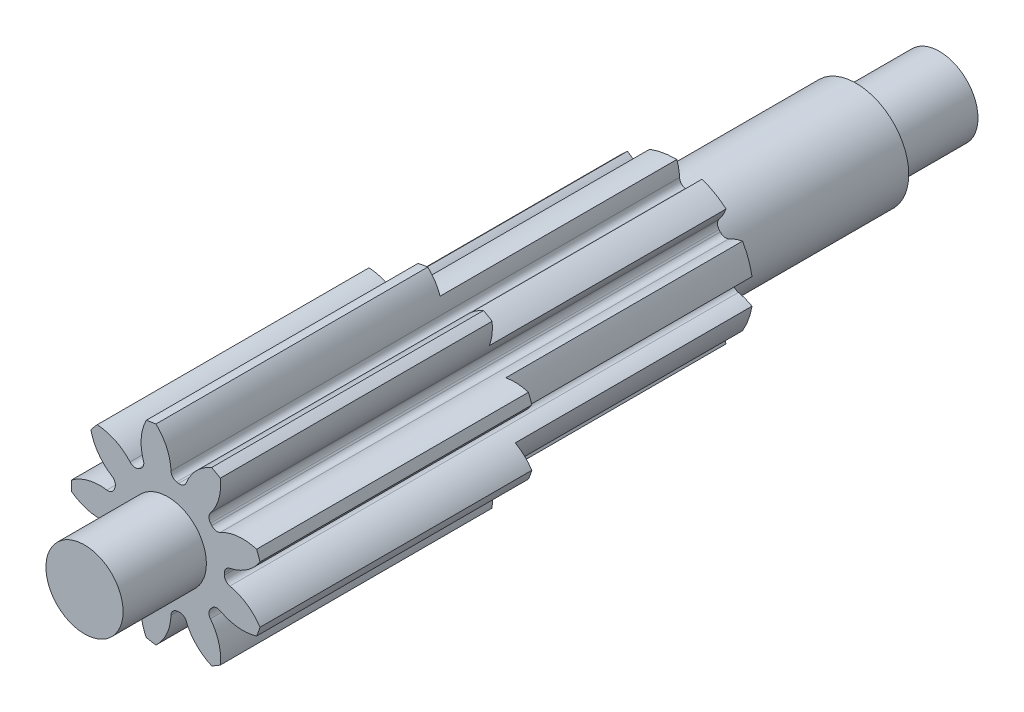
ISO-10303-21;
HEADER;
FILE_DESCRIPTION(('STEP AP214'),'2;1');
FILE_NAME('part.step','',(''),(''),'','','');
FILE_SCHEMA(('AUTOMOTIVE_DESIGN { 1 0 10303 214 1 1 1 1 }'));
ENDSEC;
DATA;
#1=APPLICATION_CONTEXT('core data for automotive mechanical design processes');
#2=APPLICATION_PROTOCOL_DEFINITION('international standard','automotive_design',2000,#1);
#3=PRODUCT_CONTEXT('',#1,'mechanical');
#4=PRODUCT('Part','Part','',(#3));
#5=PRODUCT_RELATED_PRODUCT_CATEGORY('part','',(#4));
#6=PRODUCT_DEFINITION_FORMATION('','',#4);
#7=PRODUCT_DEFINITION_CONTEXT('part definition',#1,'design');
#8=PRODUCT_DEFINITION('design','',#6,#7);
#9=PRODUCT_DEFINITION_SHAPE('','',#8);
#10=(LENGTH_UNIT() NAMED_UNIT(*) SI_UNIT(.MILLI.,.METRE.));
#11=(NAMED_UNIT(*) PLANE_ANGLE_UNIT() SI_UNIT($,.RADIAN.));
#12=(NAMED_UNIT(*) SI_UNIT($,.STERADIAN.) SOLID_ANGLE_UNIT());
#13=UNCERTAINTY_MEASURE_WITH_UNIT(LENGTH_MEASURE(1.E-05),#10,'distance_accuracy_value','');
#14=(GEOMETRIC_REPRESENTATION_CONTEXT(3) GLOBAL_UNCERTAINTY_ASSIGNED_CONTEXT((#13)) GLOBAL_UNIT_ASSIGNED_CONTEXT((#10,
#11,#12)) REPRESENTATION_CONTEXT('',''));
#15=CARTESIAN_POINT('',(0.,0.,0.));
#16=DIRECTION('',(0.,0.,1.));
#17=DIRECTION('',(1.,0.,0.));
#18=AXIS2_PLACEMENT_3D('',#15,#16,#17);
#19=CARTESIAN_POINT('',(0.,0.,4.875));
#20=DIRECTION('',(0.,0.,1.));
#21=DIRECTION('',(1.,0.,0.));
#22=AXIS2_PLACEMENT_3D('',#19,#20,#21);
#23=CYLINDRICAL_SURFACE('',#22,0.875);
#24=DIRECTION('',(0.,0.,1.));
#25=VECTOR('',#24,1.);
#26=CARTESIAN_POINT('',(0.862735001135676,0.145990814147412,-0.525));
#27=LINE('',#26,#25);
#28=CARTESIAN_POINT('',(0.862735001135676,0.145990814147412,0.825));
#29=VERTEX_POINT('',#28);
#30=CARTESIAN_POINT('',(0.862735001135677,0.145990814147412,-1.875));
#31=VERTEX_POINT('',#30);
#32=EDGE_CURVE('E998',#29,#31,#27,.F.);
#33=ORIENTED_EDGE('',*,*,#32,.T.);
#34=CARTESIAN_POINT('',(0.,0.,-1.875));
#35=DIRECTION('',(0.,0.,1.));
#36=DIRECTION('',(1.,0.,0.));
#37=AXIS2_PLACEMENT_3D('',#34,#35,#36);
#38=CIRCLE('',#37,0.875);
#39=CARTESIAN_POINT('',(0.754734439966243,0.442719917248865,-1.875));
#40=VERTEX_POINT('',#39);
#41=EDGE_CURVE('E1124',#31,#40,#38,.T.);
#42=ORIENTED_EDGE('',*,*,#41,.T.);
#43=DIRECTION('',(0.,0.,1.));
#44=VECTOR('',#43,1.);
#45=CARTESIAN_POINT('',(0.754734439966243,0.442719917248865,-0.525));
#46=LINE('',#45,#44);
#47=CARTESIAN_POINT('',(0.754734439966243,0.442719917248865,0.825));
#48=VERTEX_POINT('',#47);
#49=EDGE_CURVE('E971',#40,#48,#46,.T.);
#50=ORIENTED_EDGE('',*,*,#49,.T.);
#51=CARTESIAN_POINT('',(0.,0.,0.825));
#52=DIRECTION('',(0.,0.,1.));
#53=DIRECTION('',(1.,0.,0.));
#54=AXIS2_PLACEMENT_3D('',#51,#52,#53);
#55=CIRCLE('',#54,0.875);
#56=EDGE_CURVE('E1117',#29,#48,#55,.T.);
#57=ORIENTED_EDGE('',*,*,#56,.F.);
#58=EDGE_LOOP('',(#33,#42,#50,#57));
#59=FACE_BOUND('',#58,.T.);
#60=ADVANCED_FACE('F41',(#59),#23,.T.);
#61=DIRECTION('',(0.,0.,1.));
#62=VECTOR('',#61,1.);
#63=CARTESIAN_POINT('',(0.862735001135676,-0.145990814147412,-0.525));
#64=LINE('',#63,#62);
#65=CARTESIAN_POINT('',(0.862735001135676,-0.145990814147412,-1.875));
#66=VERTEX_POINT('',#65);
#67=CARTESIAN_POINT('',(0.862735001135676,-0.145990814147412,0.825));
#68=VERTEX_POINT('',#67);
#69=EDGE_CURVE('E995',#66,#68,#64,.T.);
#70=ORIENTED_EDGE('',*,*,#69,.T.);
#71=CARTESIAN_POINT('',(0.754734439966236,-0.442719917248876,0.825));
#72=VERTEX_POINT('',#71);
#73=EDGE_CURVE('E1123',#72,#68,#55,.T.);
#74=ORIENTED_EDGE('',*,*,#73,.F.);
#75=DIRECTION('',(0.,0.,1.));
#76=VECTOR('',#75,1.);
#77=CARTESIAN_POINT('',(0.754734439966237,-0.442719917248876,-0.525));
#78=LINE('',#77,#76);
#79=CARTESIAN_POINT('',(0.754734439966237,-0.442719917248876,-1.875));
#80=VERTEX_POINT('',#79);
#81=EDGE_CURVE('E992',#72,#80,#78,.F.);
#82=ORIENTED_EDGE('',*,*,#81,.T.);
#83=EDGE_CURVE('E1121',#80,#66,#38,.T.);
#84=ORIENTED_EDGE('',*,*,#83,.T.);
#85=EDGE_LOOP('',(#70,#74,#82,#84));
#86=FACE_BOUND('',#85,.T.);
#87=ADVANCED_FACE('F1403',(#86),#23,.T.);
#88=DIRECTION('',(0.,0.,1.));
#89=VECTOR('',#88,1.);
#90=CARTESIAN_POINT('',(0.567052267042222,-0.666390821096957,-0.525));
#91=LINE('',#90,#89);
#92=CARTESIAN_POINT('',(0.567052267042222,-0.666390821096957,-1.875));
#93=VERTEX_POINT('',#92);
#94=CARTESIAN_POINT('',(0.567052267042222,-0.666390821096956,0.825));
#95=VERTEX_POINT('',#94);
#96=EDGE_CURVE('E989',#93,#95,#91,.T.);
#97=ORIENTED_EDGE('',*,*,#96,.T.);
#98=CARTESIAN_POINT('',(0.29358524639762,-0.824277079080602,0.825));
#99=VERTEX_POINT('',#98);
#100=EDGE_CURVE('E1116',#99,#95,#55,.T.);
#101=ORIENTED_EDGE('',*,*,#100,.F.);
#102=DIRECTION('',(0.,0.,1.));
#103=VECTOR('',#102,1.);
#104=CARTESIAN_POINT('',(0.293585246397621,-0.824277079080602,-0.525));
#105=LINE('',#104,#103);
#106=CARTESIAN_POINT('',(0.293585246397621,-0.824277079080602,-1.875));
#107=VERTEX_POINT('',#106);
#108=EDGE_CURVE('E968',#99,#107,#105,.F.);
#109=ORIENTED_EDGE('',*,*,#108,.T.);
#110=EDGE_CURVE('E1281',#107,#93,#38,.T.);
#111=ORIENTED_EDGE('',*,*,#110,.T.);
#112=EDGE_LOOP('',(#97,#101,#109,#111));
#113=FACE_BOUND('',#112,.T.);
#114=ADVANCED_FACE('F1409',(#113),#23,.T.);
#115=DIRECTION('',(0.,0.,1.));
#116=VECTOR('',#115,1.);
#117=CARTESIAN_POINT('',(-0.557799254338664,0.674155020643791,-0.525));
#118=LINE('',#117,#116);
#119=CARTESIAN_POINT('',(-0.557799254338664,0.674155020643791,0.825));
#120=VERTEX_POINT('',#119);
#121=CARTESIAN_POINT('',(-0.557799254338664,0.674155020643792,-1.875));
#122=VERTEX_POINT('',#121);
#123=EDGE_CURVE('E986',#120,#122,#118,.F.);
#124=ORIENTED_EDGE('',*,*,#123,.T.);
#125=CARTESIAN_POINT('',(-0.760773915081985,0.432259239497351,-1.875));
#126=VERTEX_POINT('',#125);
#127=EDGE_CURVE('E1271',#122,#126,#38,.T.);
#128=ORIENTED_EDGE('',*,*,#127,.T.);
#129=DIRECTION('',(0.,0.,1.));
#130=VECTOR('',#129,1.);
#131=CARTESIAN_POINT('',(-0.760773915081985,0.432259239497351,-0.525));
#132=LINE('',#131,#130);
#133=CARTESIAN_POINT('',(-0.760773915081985,0.432259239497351,0.825));
#134=VERTEX_POINT('',#133);
#135=EDGE_CURVE('E11',#126,#134,#132,.T.);
#136=ORIENTED_EDGE('',*,*,#135,.T.);
#137=EDGE_CURVE('E530',#120,#134,#55,.T.);
#138=ORIENTED_EDGE('',*,*,#137,.F.);
#139=EDGE_LOOP('',(#124,#128,#136,#138));
#140=FACE_BOUND('',#139,.T.);
#141=ADVANCED_FACE('F1336',(#140),#23,.T.);
#142=DIRECTION('',(0.,0.,1.));
#143=VECTOR('',#142,1.);
#144=CARTESIAN_POINT('',(-0.304935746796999,0.820145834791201,-0.525));
#145=LINE('',#144,#143);
#146=CARTESIAN_POINT('',(-0.304935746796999,0.820145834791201,-1.875));
#147=VERTEX_POINT('',#146);
#148=CARTESIAN_POINT('',(-0.304935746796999,0.820145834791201,0.825));
#149=VERTEX_POINT('',#148);
#150=EDGE_CURVE('E983',#147,#149,#145,.T.);
#151=ORIENTED_EDGE('',*,*,#150,.T.);
#152=CARTESIAN_POINT('',(0.00603947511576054,0.87497915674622,0.825));
#153=VERTEX_POINT('',#152);
#154=EDGE_CURVE('E1288',#153,#149,#55,.T.);
#155=ORIENTED_EDGE('',*,*,#154,.F.);
#156=DIRECTION('',(0.,0.,1.));
#157=VECTOR('',#156,1.);
#158=CARTESIAN_POINT('',(0.00603947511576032,0.87497915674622,-0.525));
#159=LINE('',#158,#157);
#160=CARTESIAN_POINT('',(0.00603947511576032,0.87497915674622,-1.875));
#161=VERTEX_POINT('',#160);
#162=EDGE_CURVE('E980',#153,#161,#159,.F.);
#163=ORIENTED_EDGE('',*,*,#162,.T.);
#164=EDGE_CURVE('E1268',#161,#147,#38,.T.);
#165=ORIENTED_EDGE('',*,*,#164,.T.);
#166=EDGE_LOOP('',(#151,#155,#163,#165));
#167=FACE_BOUND('',#166,.T.);
#168=ADVANCED_FACE('F1312',(#167),#23,.T.);
#169=DIRECTION('',(0.,0.,1.));
#170=VECTOR('',#169,1.);
#171=CARTESIAN_POINT('',(0.293585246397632,0.824277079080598,-0.525));
#172=LINE('',#171,#170);
#173=CARTESIAN_POINT('',(0.293585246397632,0.824277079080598,-1.875));
#174=VERTEX_POINT('',#173);
#175=CARTESIAN_POINT('',(0.293585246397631,0.824277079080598,0.825));
#176=VERTEX_POINT('',#175);
#177=EDGE_CURVE('E977',#174,#176,#172,.T.);
#178=ORIENTED_EDGE('',*,*,#177,.T.);
#179=CARTESIAN_POINT('',(0.567052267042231,0.666390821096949,0.825));
#180=VERTEX_POINT('',#179);
#181=EDGE_CURVE('E1122',#180,#176,#55,.T.);
#182=ORIENTED_EDGE('',*,*,#181,.F.);
#183=DIRECTION('',(0.,0.,1.));
#184=VECTOR('',#183,1.);
#185=CARTESIAN_POINT('',(0.567052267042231,0.666390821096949,-0.525));
#186=LINE('',#185,#184);
#187=CARTESIAN_POINT('',(0.567052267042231,0.666390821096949,-1.875));
#188=VERTEX_POINT('',#187);
#189=EDGE_CURVE('E974',#180,#188,#186,.F.);
#190=ORIENTED_EDGE('',*,*,#189,.T.);
#191=EDGE_CURVE('E1129',#188,#174,#38,.T.);
#192=ORIENTED_EDGE('',*,*,#191,.T.);
#193=EDGE_LOOP('',(#178,#182,#190,#192));
#194=FACE_BOUND('',#193,.T.);
#195=ADVANCED_FACE('F1424',(#194),#23,.T.);
#196=DIRECTION('',(0.,0.,1.));
#197=VECTOR('',#196,1.);
#198=CARTESIAN_POINT('',(0.00603947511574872,-0.87497915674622,-0.525));
#199=LINE('',#198,#197);
#200=CARTESIAN_POINT('',(0.00603947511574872,-0.87497915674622,-1.875));
#201=VERTEX_POINT('',#200);
#202=CARTESIAN_POINT('',(0.00603947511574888,-0.87497915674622,0.825));
#203=VERTEX_POINT('',#202);
#204=EDGE_CURVE('E965',#201,#203,#199,.T.);
#205=ORIENTED_EDGE('',*,*,#204,.T.);
#206=CARTESIAN_POINT('',(-0.30493574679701,-0.820145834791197,0.825));
#207=VERTEX_POINT('',#206);
#208=EDGE_CURVE('E1110',#207,#203,#55,.T.);
#209=ORIENTED_EDGE('',*,*,#208,.F.);
#210=DIRECTION('',(0.,0.,1.));
#211=VECTOR('',#210,1.);
#212=CARTESIAN_POINT('',(-0.30493574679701,-0.820145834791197,-0.525));
#213=LINE('',#212,#211);
#214=CARTESIAN_POINT('',(-0.30493574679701,-0.820145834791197,-1.875));
#215=VERTEX_POINT('',#214);
#216=EDGE_CURVE('E962',#207,#215,#213,.F.);
#217=ORIENTED_EDGE('',*,*,#216,.T.);
#218=EDGE_CURVE('E1278',#215,#201,#38,.T.);
#219=ORIENTED_EDGE('',*,*,#218,.T.);
#220=EDGE_LOOP('',(#205,#209,#217,#219));
#221=FACE_BOUND('',#220,.T.);
#222=ADVANCED_FACE('F1420',(#221),#23,.T.);
#223=DIRECTION('',(0.,0.,1.));
#224=VECTOR('',#223,1.);
#225=CARTESIAN_POINT('',(-0.557799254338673,-0.674155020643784,-0.525));
#226=LINE('',#225,#224);
#227=CARTESIAN_POINT('',(-0.557799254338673,-0.674155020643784,-1.875));
#228=VERTEX_POINT('',#227);
#229=CARTESIAN_POINT('',(-0.557799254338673,-0.674155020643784,0.825));
#230=VERTEX_POINT('',#229);
#231=EDGE_CURVE('E959',#228,#230,#226,.T.);
#232=ORIENTED_EDGE('',*,*,#231,.T.);
#233=CARTESIAN_POINT('',(-0.760773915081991,-0.432259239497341,0.825));
#234=VERTEX_POINT('',#233);
#235=EDGE_CURVE('E1102',#234,#230,#55,.T.);
#236=ORIENTED_EDGE('',*,*,#235,.F.);
#237=DIRECTION('',(0.,0.,1.));
#238=VECTOR('',#237,1.);
#239=CARTESIAN_POINT('',(-0.760773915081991,-0.432259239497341,-0.525));
#240=LINE('',#239,#238);
#241=CARTESIAN_POINT('',(-0.760773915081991,-0.432259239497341,-1.875));
#242=VERTEX_POINT('',#241);
#243=EDGE_CURVE('E956',#234,#242,#240,.F.);
#244=ORIENTED_EDGE('',*,*,#243,.T.);
#245=EDGE_CURVE('E1104',#242,#228,#38,.T.);
#246=ORIENTED_EDGE('',*,*,#245,.T.);
#247=EDGE_LOOP('',(#232,#236,#244,#246));
#248=FACE_BOUND('',#247,.T.);
#249=ADVANCED_FACE('F1101',(#248),#23,.T.);
#250=DIRECTION('',(0.,0.,1.));
#251=VECTOR('',#250,1.);
#252=CARTESIAN_POINT('',(-0.860637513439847,-0.15788625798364,-0.525));
#253=LINE('',#252,#251);
#254=CARTESIAN_POINT('',(-0.860637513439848,-0.157886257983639,-1.875));
#255=VERTEX_POINT('',#254);
#256=CARTESIAN_POINT('',(-0.860637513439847,-0.157886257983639,0.825));
#257=VERTEX_POINT('',#256);
#258=EDGE_CURVE('E953',#255,#257,#253,.T.);
#259=ORIENTED_EDGE('',*,*,#258,.T.);
#260=CARTESIAN_POINT('',(-0.860637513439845,0.157886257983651,0.825));
#261=VERTEX_POINT('',#260);
#262=EDGE_CURVE('E1109',#261,#257,#55,.T.);
#263=ORIENTED_EDGE('',*,*,#262,.F.);
#264=DIRECTION('',(0.,0.,1.));
#265=VECTOR('',#264,1.);
#266=CARTESIAN_POINT('',(-0.860637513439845,0.157886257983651,-0.525));
#267=LINE('',#266,#265);
#268=CARTESIAN_POINT('',(-0.860637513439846,0.157886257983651,-1.875));
#269=VERTEX_POINT('',#268);
#270=EDGE_CURVE('E950',#261,#269,#267,.F.);
#271=ORIENTED_EDGE('',*,*,#270,.T.);
#272=EDGE_CURVE('E1274',#269,#255,#38,.T.);
#273=ORIENTED_EDGE('',*,*,#272,.T.);
#274=EDGE_LOOP('',(#259,#263,#271,#273));
#275=FACE_BOUND('',#274,.T.);
#276=ADVANCED_FACE('F1364',(#275),#23,.T.);
#277=CARTESIAN_POINT('',(0.,0.875,0.825));
#278=DIRECTION('',(0.,0.,-1.));
#279=DIRECTION('',(-1.,0.,0.));
#280=AXIS2_PLACEMENT_3D('',#277,#278,#279);
#281=PLANE('',#280);
#282=CARTESIAN_POINT('',(0.596390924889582,-0.620435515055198,0.825));
#283=DIRECTION('',(0.,0.,-1.));
#284=DIRECTION('',(-1.,0.,0.));
#285=AXIS2_PLACEMENT_3D('',#282,#283,#284);
#286=CIRCLE('',#285,0.544092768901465);
#287=CARTESIAN_POINT('',(1.05166212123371,-0.32250082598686,0.825));
#288=VERTEX_POINT('',#287);
#289=EDGE_CURVE('E947',#68,#288,#286,.T.);
#290=ORIENTED_EDGE('',*,*,#289,.T.);
#291=CARTESIAN_POINT('',(0.,0.,0.825));
#292=DIRECTION('',(0.,0.,-1.));
#293=DIRECTION('',(-1.,0.,0.));
#294=AXIS2_PLACEMENT_3D('',#291,#292,#293);
#295=CIRCLE('',#294,1.1);
#296=CARTESIAN_POINT('',(1.01291945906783,-0.428945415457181,0.825));
#297=VERTEX_POINT('',#296);
#298=EDGE_CURVE('E943',#297,#288,#295,.F.);
#299=ORIENTED_EDGE('',*,*,#298,.F.);
#300=CARTESIAN_POINT('',(0.85567021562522,0.091928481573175,0.825));
#301=DIRECTION('',(0.,0.,-1.));
#302=DIRECTION('',(-1.,0.,0.));
#303=AXIS2_PLACEMENT_3D('',#300,#301,#302);
#304=CIRCLE('',#303,0.544092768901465);
#305=EDGE_CURVE('E940',#297,#72,#304,.T.);
#306=ORIENTED_EDGE('',*,*,#305,.T.);
#307=ORIENTED_EDGE('',*,*,#73,.T.);
#308=EDGE_LOOP('',(#290,#299,#306,#307));
#309=FACE_BOUND('',#308,.T.);
#310=ADVANCED_FACE('F1414',(#309),#281,.T.);
#311=CARTESIAN_POINT('',(0.2391174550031,0.826707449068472,0.825));
#312=DIRECTION('',(0.,0.,-1.));
#313=DIRECTION('',(-1.,0.,0.));
#314=AXIS2_PLACEMENT_3D('',#311,#312,#313);
#315=CIRCLE('',#314,0.544092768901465);
#316=CARTESIAN_POINT('',(-0.246537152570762,1.07201652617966,0.825));
#317=VERTEX_POINT('',#316);
#318=EDGE_CURVE('E937',#149,#317,#315,.T.);
#319=ORIENTED_EDGE('',*,*,#318,.T.);
#320=CARTESIAN_POINT('',(0.,0.,0.825));
#321=DIRECTION('',(0.,0.,-1.));
#322=DIRECTION('',(-1.,0.,0.));
#323=AXIS2_PLACEMENT_3D('',#320,#321,#322);
#324=CIRCLE('',#323,1.1);
#325=CARTESIAN_POINT('',(-0.134982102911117,1.09168669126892,0.825));
#326=VERTEX_POINT('',#325);
#327=EDGE_CURVE('E933',#326,#317,#324,.F.);
#328=ORIENTED_EDGE('',*,*,#327,.F.);
#329=CARTESIAN_POINT('',(-0.507447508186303,0.695067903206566,0.825));
#330=DIRECTION('',(0.,0.,-1.));
#331=DIRECTION('',(-1.,0.,0.));
#332=AXIS2_PLACEMENT_3D('',#329,#330,#331);
#333=CIRCLE('',#332,0.544092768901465);
#334=EDGE_CURVE('E930',#326,#153,#333,.T.);
#335=ORIENTED_EDGE('',*,*,#334,.T.);
#336=ORIENTED_EDGE('',*,*,#154,.T.);
#337=EDGE_LOOP('',(#319,#328,#335,#336));
#338=FACE_BOUND('',#337,.T.);
#339=ADVANCED_FACE('F1294',(#338),#281,.T.);
#340=CARTESIAN_POINT('',(0.714571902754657,0.479592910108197,0.825));
#341=DIRECTION('',(0.,0.,-1.));
#342=DIRECTION('',(-1.,0.,0.));
#343=AXIS2_PLACEMENT_3D('',#340,#341,#342);
#344=CIRCLE('',#343,0.544092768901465);
#345=CARTESIAN_POINT('',(0.500220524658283,0.979683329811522,0.825));
#346=VERTEX_POINT('',#345);
#347=EDGE_CURVE('E927',#176,#346,#344,.T.);
#348=ORIENTED_EDGE('',*,*,#347,.T.);
#349=CARTESIAN_POINT('',(0.,0.,0.825));
#350=DIRECTION('',(0.,0.,-1.));
#351=DIRECTION('',(-1.,0.,0.));
#352=AXIS2_PLACEMENT_3D('',#349,#350,#351);
#353=CIRCLE('',#352,1.1);
#354=CARTESIAN_POINT('',(0.598320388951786,0.923045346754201,0.825));
#355=VERTEX_POINT('',#354);
#356=EDGE_CURVE('E923',#355,#346,#353,.F.);
#357=ORIENTED_EDGE('',*,*,#356,.F.);
#358=CARTESIAN_POINT('',(0.0580536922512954,0.858633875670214,0.825));
#359=DIRECTION('',(0.,0.,-1.));
#360=DIRECTION('',(-1.,0.,0.));
#361=AXIS2_PLACEMENT_3D('',#358,#359,#360);
#362=CIRCLE('',#361,0.544092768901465);
#363=EDGE_CURVE('E920',#355,#180,#362,.T.);
#364=ORIENTED_EDGE('',*,*,#363,.T.);
#365=ORIENTED_EDGE('',*,*,#181,.T.);
#366=EDGE_LOOP('',(#348,#357,#364,#365));
#367=FACE_BOUND('',#366,.T.);
#368=ADVANCED_FACE('F1601',(#367),#281,.T.);
#369=CARTESIAN_POINT('',(0.596390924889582,0.620435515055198,0.825));
#370=DIRECTION('',(0.,0.,-1.));
#371=DIRECTION('',(-1.,0.,0.));
#372=AXIS2_PLACEMENT_3D('',#369,#370,#371);
#373=CIRCLE('',#372,0.544092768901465);
#374=CARTESIAN_POINT('',(1.05166212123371,0.32250082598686,0.825));
#375=VERTEX_POINT('',#374);
#376=EDGE_CURVE('E917',#375,#29,#373,.T.);
#377=ORIENTED_EDGE('',*,*,#376,.T.);
#378=ORIENTED_EDGE('',*,*,#56,.T.);
#379=CARTESIAN_POINT('',(0.855670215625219,-0.0919284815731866,0.825));
#380=DIRECTION('',(0.,0.,-1.));
#381=DIRECTION('',(-1.,0.,0.));
#382=AXIS2_PLACEMENT_3D('',#379,#380,#381);
#383=CIRCLE('',#382,0.544092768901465);
#384=CARTESIAN_POINT('',(1.01291945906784,0.428945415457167,0.825));
#385=VERTEX_POINT('',#384);
#386=EDGE_CURVE('E910',#48,#385,#383,.T.);
#387=ORIENTED_EDGE('',*,*,#386,.T.);
#388=CARTESIAN_POINT('',(0.,0.,0.825));
#389=DIRECTION('',(0.,0.,-1.));
#390=DIRECTION('',(-1.,0.,0.));
#391=AXIS2_PLACEMENT_3D('',#388,#389,#390);
#392=CIRCLE('',#391,1.1);
#393=EDGE_CURVE('E913',#375,#385,#392,.F.);
#394=ORIENTED_EDGE('',*,*,#393,.F.);
#395=EDGE_LOOP('',(#377,#378,#387,#394));
#396=FACE_BOUND('',#395,.T.);
#397=ADVANCED_FACE('F1549',(#396),#281,.T.);
#398=CARTESIAN_POINT('',(0.0580536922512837,-0.858633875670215,0.825));
#399=DIRECTION('',(0.,0.,-1.));
#400=DIRECTION('',(-1.,0.,0.));
#401=AXIS2_PLACEMENT_3D('',#398,#399,#400);
#402=CIRCLE('',#401,0.544092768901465);
#403=CARTESIAN_POINT('',(0.598320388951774,-0.923045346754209,0.825));
#404=VERTEX_POINT('',#403);
#405=EDGE_CURVE('E907',#95,#404,#402,.T.);
#406=ORIENTED_EDGE('',*,*,#405,.T.);
#407=CARTESIAN_POINT('',(0.,0.,0.825));
#408=DIRECTION('',(0.,0.,-1.));
#409=DIRECTION('',(-1.,0.,0.));
#410=AXIS2_PLACEMENT_3D('',#407,#408,#409);
#411=CIRCLE('',#410,1.1);
#412=CARTESIAN_POINT('',(0.50022052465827,-0.979683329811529,0.825));
#413=VERTEX_POINT('',#412);
#414=EDGE_CURVE('E903',#413,#404,#411,.F.);
#415=ORIENTED_EDGE('',*,*,#414,.F.);
#416=CARTESIAN_POINT('',(0.714571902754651,-0.479592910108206,0.825));
#417=DIRECTION('',(0.,0.,-1.));
#418=DIRECTION('',(-1.,0.,0.));
#419=AXIS2_PLACEMENT_3D('',#416,#417,#418);
#420=CIRCLE('',#419,0.544092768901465);
#421=EDGE_CURVE('E900',#413,#99,#420,.T.);
#422=ORIENTED_EDGE('',*,*,#421,.T.);
#423=ORIENTED_EDGE('',*,*,#100,.T.);
#424=EDGE_LOOP('',(#406,#415,#422,#423));
#425=FACE_BOUND('',#424,.T.);
#426=ADVANCED_FACE('F1558',(#425),#281,.T.);
#427=CARTESIAN_POINT('',(-0.507447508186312,-0.695067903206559,0.825));
#428=DIRECTION('',(0.,0.,-1.));
#429=DIRECTION('',(-1.,0.,0.));
#430=AXIS2_PLACEMENT_3D('',#427,#428,#429);
#431=CIRCLE('',#430,0.544092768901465);
#432=CARTESIAN_POINT('',(-0.134982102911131,-1.09168669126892,0.825));
#433=VERTEX_POINT('',#432);
#434=EDGE_CURVE('E897',#203,#433,#431,.T.);
#435=ORIENTED_EDGE('',*,*,#434,.T.);
#436=CARTESIAN_POINT('',(0.,0.,0.825));
#437=DIRECTION('',(0.,0.,-1.));
#438=DIRECTION('',(-1.,0.,0.));
#439=AXIS2_PLACEMENT_3D('',#436,#437,#438);
#440=CIRCLE('',#439,1.1);
#441=CARTESIAN_POINT('',(-0.246537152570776,-1.07201652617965,0.825));
#442=VERTEX_POINT('',#441);
#443=EDGE_CURVE('E893',#442,#433,#440,.F.);
#444=ORIENTED_EDGE('',*,*,#443,.F.);
#445=CARTESIAN_POINT('',(0.239117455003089,-0.826707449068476,0.825));
#446=DIRECTION('',(0.,0.,-1.));
#447=DIRECTION('',(-1.,0.,0.));
#448=AXIS2_PLACEMENT_3D('',#445,#446,#447);
#449=CIRCLE('',#448,0.544092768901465);
#450=EDGE_CURVE('E890',#442,#207,#449,.T.);
#451=ORIENTED_EDGE('',*,*,#450,.T.);
#452=ORIENTED_EDGE('',*,*,#208,.T.);
#453=EDGE_LOOP('',(#435,#444,#451,#452));
#454=FACE_BOUND('',#453,.T.);
#455=ADVANCED_FACE('F1438',(#454),#281,.T.);
#456=CARTESIAN_POINT('',(-0.835508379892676,-0.206271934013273,0.825));
#457=DIRECTION('',(0.,0.,-1.));
#458=DIRECTION('',(-1.,0.,0.));
#459=AXIS2_PLACEMENT_3D('',#456,#457,#458);
#460=CIRCLE('',#459,0.544092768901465);
#461=CARTESIAN_POINT('',(-0.805124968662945,-0.749515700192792,0.825));
#462=VERTEX_POINT('',#461);
#463=EDGE_CURVE('E887',#230,#462,#460,.T.);
#464=ORIENTED_EDGE('',*,*,#463,.T.);
#465=CARTESIAN_POINT('',(0.,0.,0.825));
#466=DIRECTION('',(0.,0.,-1.));
#467=DIRECTION('',(-1.,0.,0.));
#468=AXIS2_PLACEMENT_3D('',#465,#466,#467);
#469=CIRCLE('',#468,1.1);
#470=CARTESIAN_POINT('',(-0.877937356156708,-0.662741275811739,0.825));
#471=VERTEX_POINT('',#470);
#472=EDGE_CURVE('E883',#471,#462,#469,.F.);
#473=ORIENTED_EDGE('',*,*,#472,.F.);
#474=CARTESIAN_POINT('',(-0.348222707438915,-0.786996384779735,0.825));
#475=DIRECTION('',(0.,0.,-1.));
#476=DIRECTION('',(-1.,0.,0.));
#477=AXIS2_PLACEMENT_3D('',#474,#475,#476);
#478=CIRCLE('',#477,0.544092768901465);
#479=EDGE_CURVE('E880',#471,#234,#478,.T.);
#480=ORIENTED_EDGE('',*,*,#479,.T.);
#481=ORIENTED_EDGE('',*,*,#235,.T.);
#482=EDGE_LOOP('',(#464,#473,#480,#481));
#483=FACE_BOUND('',#482,.T.);
#484=ADVANCED_FACE('F1106',(#483),#281,.T.);
#485=CARTESIAN_POINT('',(-0.772625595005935,0.379040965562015,0.825));
#486=DIRECTION('',(0.,0.,-1.));
#487=DIRECTION('',(-1.,0.,0.));
#488=AXIS2_PLACEMENT_3D('',#485,#486,#487);
#489=CIRCLE('',#488,0.544092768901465);
#490=CARTESIAN_POINT('',(-1.09854091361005,-0.0566379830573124,0.825));
#491=VERTEX_POINT('',#490);
#492=EDGE_CURVE('E877',#257,#491,#489,.T.);
#493=ORIENTED_EDGE('',*,*,#492,.T.);
#494=CARTESIAN_POINT('',(0.,0.,0.825));
#495=DIRECTION('',(0.,0.,-1.));
#496=DIRECTION('',(-1.,0.,0.));
#497=AXIS2_PLACEMENT_3D('',#494,#495,#496);
#498=CIRCLE('',#497,1.1);
#499=CARTESIAN_POINT('',(-1.09854091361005,0.0566379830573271,0.825));
#500=VERTEX_POINT('',#499);
#501=EDGE_CURVE('E873',#500,#491,#498,.F.);
#502=ORIENTED_EDGE('',*,*,#501,.F.);
#503=CARTESIAN_POINT('',(-0.77262559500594,-0.379040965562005,0.825));
#504=DIRECTION('',(0.,0.,-1.));
#505=DIRECTION('',(-1.,0.,0.));
#506=AXIS2_PLACEMENT_3D('',#503,#504,#505);
#507=CIRCLE('',#506,0.544092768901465);
#508=EDGE_CURVE('E870',#500,#261,#507,.T.);
#509=ORIENTED_EDGE('',*,*,#508,.T.);
#510=ORIENTED_EDGE('',*,*,#262,.T.);
#511=EDGE_LOOP('',(#493,#502,#509,#510));
#512=FACE_BOUND('',#511,.T.);
#513=ADVANCED_FACE('F1362',(#512),#281,.T.);
#514=CARTESIAN_POINT('',(-0.835508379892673,0.206271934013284,0.825));
#515=DIRECTION('',(0.,0.,-1.));
#516=DIRECTION('',(-1.,0.,0.));
#517=AXIS2_PLACEMENT_3D('',#514,#515,#516);
#518=CIRCLE('',#517,0.544092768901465);
#519=CARTESIAN_POINT('',(-0.805124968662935,0.749515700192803,0.825));
#520=VERTEX_POINT('',#519);
#521=EDGE_CURVE('E543',#520,#120,#518,.T.);
#522=ORIENTED_EDGE('',*,*,#521,.T.);
#523=ORIENTED_EDGE('',*,*,#137,.T.);
#524=CARTESIAN_POINT('',(-0.348222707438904,0.78699638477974,0.825));
#525=DIRECTION('',(0.,0.,-1.));
#526=DIRECTION('',(-1.,0.,0.));
#527=AXIS2_PLACEMENT_3D('',#524,#525,#526);
#528=CIRCLE('',#527,0.544092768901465);
#529=CARTESIAN_POINT('',(-0.877937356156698,0.66274127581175,0.825));
#530=VERTEX_POINT('',#529);
#531=EDGE_CURVE('E50',#134,#530,#528,.T.);
#532=ORIENTED_EDGE('',*,*,#531,.T.);
#533=CARTESIAN_POINT('',(0.,0.,0.825));
#534=DIRECTION('',(0.,0.,-1.));
#535=DIRECTION('',(-1.,0.,0.));
#536=AXIS2_PLACEMENT_3D('',#533,#534,#535);
#537=CIRCLE('',#536,1.1);
#538=EDGE_CURVE('E527',#520,#530,#537,.F.);
#539=ORIENTED_EDGE('',*,*,#538,.F.);
#540=EDGE_LOOP('',(#522,#523,#532,#539));
#541=FACE_BOUND('',#540,.T.);
#542=ADVANCED_FACE('F526',(#541),#281,.T.);
#543=CARTESIAN_POINT('',(0.,0.875,-1.875));
#544=DIRECTION('',(0.,0.,-1.));
#545=DIRECTION('',(-1.,0.,0.));
#546=AXIS2_PLACEMENT_3D('',#543,#544,#545);
#547=PLANE('',#546);
#548=CARTESIAN_POINT('',(0.,0.,-1.875));
#549=DIRECTION('',(0.,0.,1.));
#550=DIRECTION('',(1.,0.,0.));
#551=AXIS2_PLACEMENT_3D('',#548,#549,#550);
#552=CIRCLE('',#551,0.6);
#553=CARTESIAN_POINT('',(0.6,0.,-1.875));
#554=VERTEX_POINT('',#553);
#555=EDGE_CURVE('E1128',#554,#554,#552,.T.);
#556=ORIENTED_EDGE('',*,*,#555,.T.);
#557=EDGE_LOOP('',(#556));
#558=FACE_BOUND('',#557,.T.);
#559=CARTESIAN_POINT('',(0.596390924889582,-0.620435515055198,-1.875));
#560=DIRECTION('',(0.,0.,-1.));
#561=DIRECTION('',(-1.,0.,0.));
#562=AXIS2_PLACEMENT_3D('',#559,#560,#561);
#563=CIRCLE('',#562,0.544092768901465);
#564=CARTESIAN_POINT('',(0.707708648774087,-0.0878519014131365,-1.875));
#565=VERTEX_POINT('',#564);
#566=EDGE_CURVE('E544',#565,#66,#563,.T.);
#567=ORIENTED_EDGE('',*,*,#566,.T.);
#568=ORIENTED_EDGE('',*,*,#83,.F.);
#569=CARTESIAN_POINT('',(0.85567021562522,0.091928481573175,-1.875));
#570=DIRECTION('',(0.,0.,-1.));
#571=DIRECTION('',(-1.,0.,0.));
#572=AXIS2_PLACEMENT_3D('',#569,#570,#571);
#573=CIRCLE('',#572,0.544092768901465);
#574=CARTESIAN_POINT('',(0.598606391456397,-0.387607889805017,-1.875));
#575=VERTEX_POINT('',#574);
#576=EDGE_CURVE('E845',#80,#575,#573,.T.);
#577=ORIENTED_EDGE('',*,*,#576,.T.);
#578=CARTESIAN_POINT('',(0.561499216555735,-0.45682898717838,-1.875));
#579=DIRECTION('',(0.,0.,-1.));
#580=DIRECTION('',(-1.,0.,0.));
#581=AXIS2_PLACEMENT_3D('',#578,#579,#580);
#582=CIRCLE('',#581,0.0785398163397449);
#583=CARTESIAN_POINT('',(0.501334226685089,-0.406344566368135,-1.875));
#584=VERTEX_POINT('',#583);
#585=EDGE_CURVE('E839',#575,#584,#582,.F.);
#586=ORIENTED_EDGE('',*,*,#585,.T.);
#587=DIRECTION('',(-0.64278760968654,-0.766044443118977,0.));
#588=VECTOR('',#587,1.);
#589=CARTESIAN_POINT('',(0.443796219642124,-0.4749156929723,-1.875));
#590=LINE('',#589,#588);
#591=CARTESIAN_POINT('',(0.487227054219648,-0.423156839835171,-1.875));
#592=VERTEX_POINT('',#591);
#593=EDGE_CURVE('E842',#584,#592,#590,.T.);
#594=ORIENTED_EDGE('',*,*,#593,.T.);
#595=CARTESIAN_POINT('',(0.547392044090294,-0.473641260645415,-1.875));
#596=DIRECTION('',(0.,0.,-1.));
#597=DIRECTION('',(-1.,0.,0.));
#598=AXIS2_PLACEMENT_3D('',#595,#596,#597);
#599=CIRCLE('',#598,0.0785398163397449);
#600=CARTESIAN_POINT('',(0.485666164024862,-0.522204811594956,-1.875));
#601=VERTEX_POINT('',#600);
#602=EDGE_CURVE('E848',#592,#601,#599,.F.);
#603=ORIENTED_EDGE('',*,*,#602,.T.);
#604=CARTESIAN_POINT('',(0.0580536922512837,-0.858633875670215,-1.875));
#605=DIRECTION('',(0.,0.,-1.));
#606=DIRECTION('',(-1.,0.,0.));
#607=AXIS2_PLACEMENT_3D('',#604,#605,#606);
#608=CIRCLE('',#607,0.544092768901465);
#609=EDGE_CURVE('E851',#601,#93,#608,.T.);
#610=ORIENTED_EDGE('',*,*,#609,.T.);
#611=ORIENTED_EDGE('',*,*,#110,.F.);
#612=CARTESIAN_POINT('',(0.714571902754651,-0.479592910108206,-1.875));
#613=DIRECTION('',(0.,0.,-1.));
#614=DIRECTION('',(-1.,0.,0.));
#615=AXIS2_PLACEMENT_3D('',#612,#613,#614);
#616=CIRCLE('',#615,0.544092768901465);
#617=CARTESIAN_POINT('',(0.209409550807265,-0.681701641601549,-1.875));
#618=VERTEX_POINT('',#617);
#619=EDGE_CURVE('E830',#107,#618,#616,.T.);
#620=ORIENTED_EDGE('',*,*,#619,.T.);
#621=CARTESIAN_POINT('',(0.136489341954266,-0.710876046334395,-1.875));
#622=DIRECTION('',(0.,0.,-1.));
#623=DIRECTION('',(-1.,0.,0.));
#624=AXIS2_PLACEMENT_3D('',#621,#622,#623);
#625=CIRCLE('',#624,0.0785398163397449);
#626=CARTESIAN_POINT('',(0.122851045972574,-0.633529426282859,-1.875));
#627=VERTEX_POINT('',#626);
#628=EDGE_CURVE('E824',#618,#627,#625,.F.);
#629=ORIENTED_EDGE('',*,*,#628,.T.);
#630=DIRECTION('',(-0.984807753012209,-0.173648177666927,0.));
#631=VECTOR('',#630,1.);
#632=CARTESIAN_POINT('',(0.0346977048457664,-0.649073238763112,-1.875));
#633=LINE('',#632,#631);
#634=CARTESIAN_POINT('',(0.10123760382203,-0.637340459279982,-1.875));
#635=VERTEX_POINT('',#634);
#636=EDGE_CURVE('E827',#627,#635,#633,.T.);
#637=ORIENTED_EDGE('',*,*,#636,.T.);
#638=CARTESIAN_POINT('',(0.114875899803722,-0.714687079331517,-1.875));
#639=DIRECTION('',(0.,0.,-1.));
#640=DIRECTION('',(-1.,0.,0.));
#641=AXIS2_PLACEMENT_3D('',#638,#639,#640);
#642=CIRCLE('',#641,0.0785398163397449);
#643=CARTESIAN_POINT('',(0.0363750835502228,-0.712212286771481,-1.875));
#644=VERTEX_POINT('',#643);
#645=EDGE_CURVE('E833',#635,#644,#642,.F.);
#646=ORIENTED_EDGE('',*,*,#645,.T.);
#647=CARTESIAN_POINT('',(-0.507447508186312,-0.695067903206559,-1.875));
#648=DIRECTION('',(0.,0.,-1.));
#649=DIRECTION('',(-1.,0.,0.));
#650=AXIS2_PLACEMENT_3D('',#647,#648,#649);
#651=CIRCLE('',#650,0.544092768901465);
#652=EDGE_CURVE('E836',#644,#201,#651,.T.);
#653=ORIENTED_EDGE('',*,*,#652,.T.);
#654=ORIENTED_EDGE('',*,*,#218,.F.);
#655=CARTESIAN_POINT('',(0.239117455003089,-0.826707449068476,-1.875));
#656=DIRECTION('',(0.,0.,-1.));
#657=DIRECTION('',(-1.,0.,0.));
#658=AXIS2_PLACEMENT_3D('',#655,#656,#657);
#659=CIRCLE('',#658,0.544092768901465);
#660=CARTESIAN_POINT('',(-0.277772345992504,-0.656819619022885,-1.875));
#661=VERTEX_POINT('',#660);
#662=EDGE_CURVE('E815',#215,#661,#659,.T.);
#663=ORIENTED_EDGE('',*,*,#662,.T.);
#664=CARTESIAN_POINT('',(-0.352385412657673,-0.632296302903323,-1.875));
#665=DIRECTION('',(0.,0.,-1.));
#666=DIRECTION('',(-1.,0.,0.));
#667=AXIS2_PLACEMENT_3D('',#664,#665,#666);
#668=CIRCLE('',#667,0.0785398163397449);
#669=CARTESIAN_POINT('',(-0.3131155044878,-0.56427882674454,-1.875));
#670=VERTEX_POINT('',#669);
#671=EDGE_CURVE('E809',#661,#670,#668,.F.);
#672=ORIENTED_EDGE('',*,*,#671,.T.);
#673=DIRECTION('',(-0.866025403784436,0.500000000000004,0.));
#674=VECTOR('',#673,1.);
#675=CARTESIAN_POINT('',(-0.39063625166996,-0.519522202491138,-1.875));
#676=LINE('',#675,#674);
#677=CARTESIAN_POINT('',(-0.332122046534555,-0.553305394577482,-1.875));
#678=VERTEX_POINT('',#677);
#679=EDGE_CURVE('E812',#670,#678,#676,.T.);
#680=ORIENTED_EDGE('',*,*,#679,.T.);
#681=CARTESIAN_POINT('',(-0.371391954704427,-0.621322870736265,-1.875));
#682=DIRECTION('',(0.,0.,-1.));
#683=DIRECTION('',(-1.,0.,0.));
#684=AXIS2_PLACEMENT_3D('',#681,#682,#683);
#685=CIRCLE('',#684,0.0785398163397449);
#686=CARTESIAN_POINT('',(-0.429936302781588,-0.568967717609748,-1.875));
#687=VERTEX_POINT('',#686);
#688=EDGE_CURVE('E818',#678,#687,#685,.F.);
#689=ORIENTED_EDGE('',*,*,#688,.T.);
#690=CARTESIAN_POINT('',(-0.835508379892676,-0.206271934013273,-1.875));
#691=DIRECTION('',(0.,0.,-1.));
#692=DIRECTION('',(-1.,0.,0.));
#693=AXIS2_PLACEMENT_3D('',#690,#691,#692);
#694=CIRCLE('',#693,0.544092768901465);
#695=EDGE_CURVE('E821',#687,#228,#694,.T.);
#696=ORIENTED_EDGE('',*,*,#695,.T.);
#697=ORIENTED_EDGE('',*,*,#245,.F.);
#698=CARTESIAN_POINT('',(-0.348222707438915,-0.786996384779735,-1.875));
#699=DIRECTION('',(0.,0.,-1.));
#700=DIRECTION('',(-1.,0.,0.));
#701=AXIS2_PLACEMENT_3D('',#698,#699,#700);
#702=CIRCLE('',#701,0.544092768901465);
#703=CARTESIAN_POINT('',(-0.634981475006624,-0.32460439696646,-1.875));
#704=VERTEX_POINT('',#703);
#705=EDGE_CURVE('E800',#242,#704,#702,.T.);
#706=ORIENTED_EDGE('',*,*,#705,.T.);
#707=CARTESIAN_POINT('',(-0.676375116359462,-0.257858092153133,-1.875));
#708=DIRECTION('',(0.,0.,-1.));
#709=DIRECTION('',(-1.,0.,0.));
#710=AXIS2_PLACEMENT_3D('',#707,#708,#709);
#711=CIRCLE('',#710,0.0785398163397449);
#712=CARTESIAN_POINT('',(-0.602571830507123,-0.230995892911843,-1.875));
#713=VERTEX_POINT('',#712);
#714=EDGE_CURVE('E794',#704,#713,#711,.F.);
#715=ORIENTED_EDGE('',*,*,#714,.T.);
#716=DIRECTION('',(-0.342020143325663,0.939692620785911,0.));
#717=VECTOR('',#716,1.);
#718=CARTESIAN_POINT('',(-0.633187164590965,-0.146880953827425,-1.875));
#719=LINE('',#718,#717);
#720=CARTESIAN_POINT('',(-0.610078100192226,-0.210372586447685,-1.875));
#721=VERTEX_POINT('',#720);
#722=EDGE_CURVE('E797',#713,#721,#719,.T.);
#723=ORIENTED_EDGE('',*,*,#722,.T.);
#724=CARTESIAN_POINT('',(-0.683881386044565,-0.237234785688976,-1.875));
#725=DIRECTION('',(0.,0.,-1.));
#726=DIRECTION('',(-1.,0.,0.));
#727=AXIS2_PLACEMENT_3D('',#724,#725,#726);
#728=CIRCLE('',#727,0.0785398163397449);
#729=CARTESIAN_POINT('',(-0.69507571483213,-0.159496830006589,-1.875));
#730=VERTEX_POINT('',#729);
#731=EDGE_CURVE('E803',#721,#730,#728,.F.);
#732=ORIENTED_EDGE('',*,*,#731,.T.);
#733=CARTESIAN_POINT('',(-0.772625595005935,0.379040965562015,-1.875));
#734=DIRECTION('',(0.,0.,-1.));
#735=DIRECTION('',(-1.,0.,0.));
#736=AXIS2_PLACEMENT_3D('',#733,#734,#735);
#737=CIRCLE('',#736,0.544092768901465);
#738=EDGE_CURVE('E806',#730,#255,#737,.T.);
#739=ORIENTED_EDGE('',*,*,#738,.T.);
#740=ORIENTED_EDGE('',*,*,#272,.F.);
#741=CARTESIAN_POINT('',(-0.77262559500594,-0.379040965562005,-1.875));
#742=DIRECTION('',(0.,0.,-1.));
#743=DIRECTION('',(-1.,0.,0.));
#744=AXIS2_PLACEMENT_3D('',#741,#742,#743);
#745=CIRCLE('',#744,0.544092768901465);
#746=CARTESIAN_POINT('',(-0.695075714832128,0.159496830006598,-1.875));
#747=VERTEX_POINT('',#746);
#748=EDGE_CURVE('E785',#269,#747,#745,.T.);
#749=ORIENTED_EDGE('',*,*,#748,.T.);
#750=CARTESIAN_POINT('',(-0.683881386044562,0.237234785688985,-1.875));
#751=DIRECTION('',(0.,0.,-1.));
#752=DIRECTION('',(-1.,0.,0.));
#753=AXIS2_PLACEMENT_3D('',#750,#751,#752);
#754=CIRCLE('',#753,0.0785398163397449);
#755=CARTESIAN_POINT('',(-0.610078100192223,0.210372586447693,-1.875));
#756=VERTEX_POINT('',#755);
#757=EDGE_CURVE('E779',#747,#756,#754,.F.);
#758=ORIENTED_EDGE('',*,*,#757,.T.);
#759=DIRECTION('',(0.342020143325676,0.939692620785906,0.));
#760=VECTOR('',#759,1.);
#761=CARTESIAN_POINT('',(-0.57946276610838,0.294487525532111,-1.875));
#762=LINE('',#761,#760);
#763=CARTESIAN_POINT('',(-0.60257183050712,0.230995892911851,-1.875));
#764=VERTEX_POINT('',#763);
#765=EDGE_CURVE('E782',#756,#764,#762,.T.);
#766=ORIENTED_EDGE('',*,*,#765,.T.);
#767=CARTESIAN_POINT('',(-0.676375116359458,0.257858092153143,-1.875));
#768=DIRECTION('',(0.,0.,-1.));
#769=DIRECTION('',(-1.,0.,0.));
#770=AXIS2_PLACEMENT_3D('',#767,#768,#769);
#771=CIRCLE('',#770,0.0785398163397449);
#772=CARTESIAN_POINT('',(-0.63498147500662,0.324604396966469,-1.875));
#773=VERTEX_POINT('',#772);
#774=EDGE_CURVE('E788',#764,#773,#771,.F.);
#775=ORIENTED_EDGE('',*,*,#774,.T.);
#776=CARTESIAN_POINT('',(-0.348222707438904,0.78699638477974,-1.875));
#777=DIRECTION('',(0.,0.,-1.));
#778=DIRECTION('',(-1.,0.,0.));
#779=AXIS2_PLACEMENT_3D('',#776,#777,#778);
#780=CIRCLE('',#779,0.544092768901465);
#781=EDGE_CURVE('E791',#773,#126,#780,.T.);
#782=ORIENTED_EDGE('',*,*,#781,.T.);
#783=ORIENTED_EDGE('',*,*,#127,.F.);
#784=CARTESIAN_POINT('',(-0.835508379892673,0.206271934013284,-1.875));
#785=DIRECTION('',(0.,0.,-1.));
#786=DIRECTION('',(-1.,0.,0.));
#787=AXIS2_PLACEMENT_3D('',#784,#785,#786);
#788=CIRCLE('',#787,0.544092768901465);
#789=CARTESIAN_POINT('',(-0.42993630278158,0.568967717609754,-1.875));
#790=VERTEX_POINT('',#789);
#791=EDGE_CURVE('E770',#122,#790,#788,.T.);
#792=ORIENTED_EDGE('',*,*,#791,.T.);
#793=CARTESIAN_POINT('',(-0.371391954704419,0.62132287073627,-1.875));
#794=DIRECTION('',(0.,0.,-1.));
#795=DIRECTION('',(-1.,0.,0.));
#796=AXIS2_PLACEMENT_3D('',#793,#794,#795);
#797=CIRCLE('',#796,0.0785398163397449);
#798=CARTESIAN_POINT('',(-0.332122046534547,0.553305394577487,-1.875));
#799=VERTEX_POINT('',#798);
#800=EDGE_CURVE('E764',#790,#799,#797,.F.);
#801=ORIENTED_EDGE('',*,*,#800,.T.);
#802=DIRECTION('',(0.866025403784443,0.499999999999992,0.));
#803=VECTOR('',#802,1.);
#804=CARTESIAN_POINT('',(-0.254601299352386,0.598062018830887,-1.875));
#805=LINE('',#804,#803);
#806=CARTESIAN_POINT('',(-0.313115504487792,0.564278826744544,-1.875));
#807=VERTEX_POINT('',#806);
#808=EDGE_CURVE('E767',#799,#807,#805,.T.);
#809=ORIENTED_EDGE('',*,*,#808,.T.);
#810=CARTESIAN_POINT('',(-0.352385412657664,0.632296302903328,-1.875));
#811=DIRECTION('',(0.,0.,-1.));
#812=DIRECTION('',(-1.,0.,0.));
#813=AXIS2_PLACEMENT_3D('',#810,#811,#812);
#814=CIRCLE('',#813,0.0785398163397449);
#815=CARTESIAN_POINT('',(-0.277772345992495,0.656819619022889,-1.875));
#816=VERTEX_POINT('',#815);
#817=EDGE_CURVE('E773',#807,#816,#814,.F.);
#818=ORIENTED_EDGE('',*,*,#817,.T.);
#819=CARTESIAN_POINT('',(0.2391174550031,0.826707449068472,-1.875));
#820=DIRECTION('',(0.,0.,-1.));
#821=DIRECTION('',(-1.,0.,0.));
#822=AXIS2_PLACEMENT_3D('',#819,#820,#821);
#823=CIRCLE('',#822,0.544092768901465);
#824=EDGE_CURVE('E776',#816,#147,#823,.T.);
#825=ORIENTED_EDGE('',*,*,#824,.T.);
#826=ORIENTED_EDGE('',*,*,#164,.F.);
#827=CARTESIAN_POINT('',(-0.507447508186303,0.695067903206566,-1.875));
#828=DIRECTION('',(0.,0.,-1.));
#829=DIRECTION('',(-1.,0.,0.));
#830=AXIS2_PLACEMENT_3D('',#827,#828,#829);
#831=CIRCLE('',#830,0.544092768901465);
#832=CARTESIAN_POINT('',(0.0363750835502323,0.71221228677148,-1.875));
#833=VERTEX_POINT('',#832);
#834=EDGE_CURVE('E755',#161,#833,#831,.T.);
#835=ORIENTED_EDGE('',*,*,#834,.T.);
#836=CARTESIAN_POINT('',(0.114875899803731,0.714687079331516,-1.875));
#837=DIRECTION('',(0.,0.,-1.));
#838=DIRECTION('',(-1.,0.,0.));
#839=AXIS2_PLACEMENT_3D('',#836,#837,#838);
#840=CIRCLE('',#839,0.0785398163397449);
#841=CARTESIAN_POINT('',(0.101237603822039,0.63734045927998,-1.875));
#842=VERTEX_POINT('',#841);
#843=EDGE_CURVE('E749',#833,#842,#840,.F.);
#844=ORIENTED_EDGE('',*,*,#843,.T.);
#845=DIRECTION('',(0.984807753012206,-0.17364817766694,0.));
#846=VECTOR('',#845,1.);
#847=CARTESIAN_POINT('',(0.189390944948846,0.621796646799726,-1.875));
#848=LINE('',#847,#846);
#849=CARTESIAN_POINT('',(0.122851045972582,0.633529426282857,-1.875));
#850=VERTEX_POINT('',#849);
#851=EDGE_CURVE('E752',#842,#850,#848,.T.);
#852=ORIENTED_EDGE('',*,*,#851,.T.);
#853=CARTESIAN_POINT('',(0.136489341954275,0.710876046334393,-1.875));
#854=DIRECTION('',(0.,0.,-1.));
#855=DIRECTION('',(-1.,0.,0.));
#856=AXIS2_PLACEMENT_3D('',#853,#854,#855);
#857=CIRCLE('',#856,0.0785398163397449);
#858=CARTESIAN_POINT('',(0.209409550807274,0.681701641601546,-1.875));
#859=VERTEX_POINT('',#858);
#860=EDGE_CURVE('E758',#850,#859,#857,.F.);
#861=ORIENTED_EDGE('',*,*,#860,.T.);
#862=CARTESIAN_POINT('',(0.714571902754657,0.479592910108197,-1.875));
#863=DIRECTION('',(0.,0.,-1.));
#864=DIRECTION('',(-1.,0.,0.));
#865=AXIS2_PLACEMENT_3D('',#862,#863,#864);
#866=CIRCLE('',#865,0.544092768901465);
#867=EDGE_CURVE('E761',#859,#174,#866,.T.);
#868=ORIENTED_EDGE('',*,*,#867,.T.);
#869=ORIENTED_EDGE('',*,*,#191,.F.);
#870=CARTESIAN_POINT('',(0.0580536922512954,0.858633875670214,-1.875));
#871=DIRECTION('',(0.,0.,-1.));
#872=DIRECTION('',(-1.,0.,0.));
#873=AXIS2_PLACEMENT_3D('',#870,#871,#872);
#874=CIRCLE('',#873,0.544092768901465);
#875=CARTESIAN_POINT('',(0.485666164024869,0.52220481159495,-1.875));
#876=VERTEX_POINT('',#875);
#877=EDGE_CURVE('E65',#188,#876,#874,.T.);
#878=ORIENTED_EDGE('',*,*,#877,.T.);
#879=CARTESIAN_POINT('',(0.547392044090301,0.473641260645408,-1.875));
#880=DIRECTION('',(0.,0.,-1.));
#881=DIRECTION('',(-1.,0.,0.));
#882=AXIS2_PLACEMENT_3D('',#879,#880,#881);
#883=CIRCLE('',#882,0.0785398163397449);
#884=CARTESIAN_POINT('',(0.487227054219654,0.423156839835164,-1.875));
#885=VERTEX_POINT('',#884);
#886=EDGE_CURVE('E498',#876,#885,#883,.F.);
#887=ORIENTED_EDGE('',*,*,#886,.T.);
#888=DIRECTION('',(0.64278760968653,-0.766044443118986,0.));
#889=VECTOR('',#888,1.);
#890=CARTESIAN_POINT('',(0.544765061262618,0.354585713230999,-1.875));
#891=LINE('',#890,#889);
#892=CARTESIAN_POINT('',(0.501334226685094,0.406344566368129,-1.875));
#893=VERTEX_POINT('',#892);
#894=EDGE_CURVE('E731',#885,#893,#891,.T.);
#895=ORIENTED_EDGE('',*,*,#894,.T.);
#896=CARTESIAN_POINT('',(0.561499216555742,0.456828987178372,-1.875));
#897=DIRECTION('',(0.,0.,-1.));
#898=DIRECTION('',(-1.,0.,0.));
#899=AXIS2_PLACEMENT_3D('',#896,#897,#898);
#900=CIRCLE('',#899,0.0785398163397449);
#901=CARTESIAN_POINT('',(0.598606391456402,0.387607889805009,-1.875));
#902=VERTEX_POINT('',#901);
#903=EDGE_CURVE('E738',#893,#902,#900,.F.);
#904=ORIENTED_EDGE('',*,*,#903,.T.);
#905=CARTESIAN_POINT('',(0.855670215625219,-0.0919284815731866,-1.875));
#906=DIRECTION('',(0.,0.,-1.));
#907=DIRECTION('',(-1.,0.,0.));
#908=AXIS2_PLACEMENT_3D('',#905,#906,#907);
#909=CIRCLE('',#908,0.544092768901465);
#910=EDGE_CURVE('E746',#902,#40,#909,.T.);
#911=ORIENTED_EDGE('',*,*,#910,.T.);
#912=ORIENTED_EDGE('',*,*,#41,.F.);
#913=CARTESIAN_POINT('',(0.596390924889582,0.620435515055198,-1.875));
#914=DIRECTION('',(0.,0.,-1.));
#915=DIRECTION('',(-1.,0.,0.));
#916=AXIS2_PLACEMENT_3D('',#913,#914,#915);
#917=CIRCLE('',#916,0.544092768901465);
#918=CARTESIAN_POINT('',(0.707708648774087,0.0878519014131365,-1.875));
#919=VERTEX_POINT('',#918);
#920=EDGE_CURVE('E860',#31,#919,#917,.T.);
#921=ORIENTED_EDGE('',*,*,#920,.T.);
#922=CARTESIAN_POINT('',(0.723777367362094,0.0109734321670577,-1.875));
#923=DIRECTION('',(0.,0.,-1.));
#924=DIRECTION('',(-1.,0.,0.));
#925=AXIS2_PLACEMENT_3D('',#922,#923,#924);
#926=CIRCLE('',#925,0.0785398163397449);
#927=CARTESIAN_POINT('',(0.645237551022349,0.0109734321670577,-1.875));
#928=VERTEX_POINT('',#927);
#929=EDGE_CURVE('E854',#919,#928,#926,.F.);
#930=ORIENTED_EDGE('',*,*,#929,.T.);
#931=DIRECTION('',(0.,-1.,0.));
#932=VECTOR('',#931,1.);
#933=CARTESIAN_POINT('',(0.645237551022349,-0.0785398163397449,-1.875));
#934=LINE('',#933,#932);
#935=CARTESIAN_POINT('',(0.645237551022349,-0.0109734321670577,-1.875));
#936=VERTEX_POINT('',#935);
#937=EDGE_CURVE('E857',#928,#936,#934,.T.);
#938=ORIENTED_EDGE('',*,*,#937,.T.);
#939=CARTESIAN_POINT('',(0.723777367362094,-0.0109734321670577,-1.875));
#940=DIRECTION('',(0.,0.,-1.));
#941=DIRECTION('',(-1.,0.,0.));
#942=AXIS2_PLACEMENT_3D('',#939,#940,#941);
#943=CIRCLE('',#942,0.0785398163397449);
#944=EDGE_CURVE('E863',#936,#565,#943,.F.);
#945=ORIENTED_EDGE('',*,*,#944,.T.);
#946=EDGE_LOOP('',(#567,#568,#577,#586,#594,#603,#610,#611,#620,#629,#637,#646,#653,#654,#663,
#672,#680,#689,#696,#697,#706,#715,#723,#732,#739,#740,#749,#758,#766,#775,#782,#783,#792,#801,
#809,#818,#825,#826,#835,#844,#852,#861,#868,#869,#878,#887,#895,#904,#911,#912,#921,#930,#938,#945));
#947=FACE_BOUND('',#946,.T.);
#948=ADVANCED_FACE('F1090',(#558,#947),#547,.T.);
#949=CARTESIAN_POINT('',(0.,0.,4.875));
#950=DIRECTION('',(0.,0.,1.));
#951=DIRECTION('',(1.,0.,0.));
#952=AXIS2_PLACEMENT_3D('',#949,#950,#951);
#953=CYLINDRICAL_SURFACE('',#952,0.44);
#954=CARTESIAN_POINT('',(0.,0.,-4.875));
#955=DIRECTION('',(0.,0.,1.));
#956=DIRECTION('',(1.,0.,0.));
#957=AXIS2_PLACEMENT_3D('',#954,#955,#956);
#958=CIRCLE('',#957,0.44);
#959=CARTESIAN_POINT('',(0.44,0.,-4.875));
#960=VERTEX_POINT('',#959);
#961=EDGE_CURVE('E1141',#960,#960,#958,.T.);
#962=ORIENTED_EDGE('',*,*,#961,.T.);
#963=EDGE_LOOP('',(#962));
#964=FACE_BOUND('',#963,.T.);
#965=CARTESIAN_POINT('',(0.,0.,-3.925));
#966=DIRECTION('',(0.,0.,1.));
#967=DIRECTION('',(1.,0.,0.));
#968=AXIS2_PLACEMENT_3D('',#965,#966,#967);
#969=CIRCLE('',#968,0.44);
#970=CARTESIAN_POINT('',(0.44,0.,-3.925));
#971=VERTEX_POINT('',#970);
#972=EDGE_CURVE('E1137',#971,#971,#969,.T.);
#973=ORIENTED_EDGE('',*,*,#972,.F.);
#974=EDGE_LOOP('',(#973));
#975=FACE_BOUND('',#974,.T.);
#976=ADVANCED_FACE('F1659',(#964,#975),#953,.T.);
#977=CARTESIAN_POINT('',(0.,0.44,-3.925));
#978=DIRECTION('',(0.,0.,-1.));
#979=DIRECTION('',(-1.,0.,0.));
#980=AXIS2_PLACEMENT_3D('',#977,#978,#979);
#981=PLANE('',#980);
#982=ORIENTED_EDGE('',*,*,#972,.T.);
#983=EDGE_LOOP('',(#982));
#984=FACE_BOUND('',#983,.T.);
#985=CARTESIAN_POINT('',(0.,0.,-3.925));
#986=DIRECTION('',(0.,0.,1.));
#987=DIRECTION('',(1.,0.,0.));
#988=AXIS2_PLACEMENT_3D('',#985,#986,#987);
#989=CIRCLE('',#988,0.6);
#990=CARTESIAN_POINT('',(0.6,0.,-3.925));
#991=VERTEX_POINT('',#990);
#992=EDGE_CURVE('E1133',#991,#991,#989,.T.);
#993=ORIENTED_EDGE('',*,*,#992,.F.);
#994=EDGE_LOOP('',(#993));
#995=FACE_BOUND('',#994,.T.);
#996=ADVANCED_FACE('F1668',(#984,#995),#981,.T.);
#997=CARTESIAN_POINT('',(0.,0.,4.875));
#998=DIRECTION('',(0.,0.,1.));
#999=DIRECTION('',(1.,0.,0.));
#1000=AXIS2_PLACEMENT_3D('',#997,#998,#999);
#1001=CYLINDRICAL_SURFACE('',#1000,0.6);
#1002=ORIENTED_EDGE('',*,*,#992,.T.);
#1003=EDGE_LOOP('',(#1002));
#1004=FACE_BOUND('',#1003,.T.);
#1005=ORIENTED_EDGE('',*,*,#555,.F.);
#1006=EDGE_LOOP('',(#1005));
#1007=FACE_BOUND('',#1006,.T.);
#1008=ADVANCED_FACE('F1678',(#1004,#1007),#1001,.T.);
#1009=CARTESIAN_POINT('',(-0.676375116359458,0.257858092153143,-4.875));
#1010=DIRECTION('',(0.,0.,1.));
#1011=DIRECTION('',(1.,0.,0.));
#1012=AXIS2_PLACEMENT_3D('',#1009,#1010,#1011);
#1013=CYLINDRICAL_SURFACE('',#1012,0.0785398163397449);
#1014=ORIENTED_EDGE('',*,*,#774,.F.);
#1015=DIRECTION('',(0.,0.,-1.));
#1016=VECTOR('',#1015,1.);
#1017=CARTESIAN_POINT('',(-0.60257183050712,0.230995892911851,-4.875));
#1018=LINE('',#1017,#1016);
#1019=CARTESIAN_POINT('',(-0.60257183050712,0.230995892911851,3.925));
#1020=VERTEX_POINT('',#1019);
#1021=EDGE_CURVE('E683',#1020,#764,#1018,.T.);
#1022=ORIENTED_EDGE('',*,*,#1021,.F.);
#1023=CARTESIAN_POINT('',(-0.676375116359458,0.257858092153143,3.925));
#1024=DIRECTION('',(0.,0.,1.));
#1025=DIRECTION('',(1.,0.,0.));
#1026=AXIS2_PLACEMENT_3D('',#1023,#1024,#1025);
#1027=CIRCLE('',#1026,0.0785398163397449);
#1028=CARTESIAN_POINT('',(-0.63498147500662,0.324604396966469,3.925));
#1029=VERTEX_POINT('',#1028);
#1030=EDGE_CURVE('E1244',#1029,#1020,#1027,.F.);
#1031=ORIENTED_EDGE('',*,*,#1030,.F.);
#1032=DIRECTION('',(0.,0.,1.));
#1033=VECTOR('',#1032,1.);
#1034=CARTESIAN_POINT('',(-0.63498147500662,0.324604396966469,-4.875));
#1035=LINE('',#1034,#1033);
#1036=EDGE_CURVE('E676',#773,#1029,#1035,.T.);
#1037=ORIENTED_EDGE('',*,*,#1036,.F.);
#1038=EDGE_LOOP('',(#1014,#1022,#1031,#1037));
#1039=FACE_BOUND('',#1038,.T.);
#1040=ADVANCED_FACE('F1342',(#1039),#1013,.F.);
#1041=CARTESIAN_POINT('',(-0.683881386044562,0.237234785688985,-4.875));
#1042=DIRECTION('',(0.,0.,1.));
#1043=DIRECTION('',(1.,0.,0.));
#1044=AXIS2_PLACEMENT_3D('',#1041,#1042,#1043);
#1045=CYLINDRICAL_SURFACE('',#1044,0.0785398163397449);
#1046=ORIENTED_EDGE('',*,*,#757,.F.);
#1047=DIRECTION('',(0.,0.,1.));
#1048=VECTOR('',#1047,1.);
#1049=CARTESIAN_POINT('',(-0.695075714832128,0.159496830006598,-4.875));
#1050=LINE('',#1049,#1048);
#1051=CARTESIAN_POINT('',(-0.695075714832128,0.159496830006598,3.925));
#1052=VERTEX_POINT('',#1051);
#1053=EDGE_CURVE('E687',#1052,#747,#1050,.F.);
#1054=ORIENTED_EDGE('',*,*,#1053,.F.);
#1055=CARTESIAN_POINT('',(-0.683881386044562,0.237234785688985,3.925));
#1056=DIRECTION('',(0.,0.,1.));
#1057=DIRECTION('',(1.,0.,0.));
#1058=AXIS2_PLACEMENT_3D('',#1055,#1056,#1057);
#1059=CIRCLE('',#1058,0.0785398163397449);
#1060=CARTESIAN_POINT('',(-0.610078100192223,0.210372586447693,3.925));
#1061=VERTEX_POINT('',#1060);
#1062=EDGE_CURVE('E1253',#1061,#1052,#1059,.F.);
#1063=ORIENTED_EDGE('',*,*,#1062,.F.);
#1064=DIRECTION('',(0.,0.,-1.));
#1065=VECTOR('',#1064,1.);
#1066=CARTESIAN_POINT('',(-0.610078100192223,0.210372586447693,4.875));
#1067=LINE('',#1066,#1065);
#1068=EDGE_CURVE('E679',#756,#1061,#1067,.F.);
#1069=ORIENTED_EDGE('',*,*,#1068,.F.);
#1070=EDGE_LOOP('',(#1046,#1054,#1063,#1069));
#1071=FACE_BOUND('',#1070,.T.);
#1072=ADVANCED_FACE('F1352',(#1071),#1045,.F.);
#1073=CARTESIAN_POINT('',(-0.57946276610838,0.294487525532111,-4.875));
#1074=DIRECTION('',(0.939692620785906,-0.342020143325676,0.));
#1075=DIRECTION('',(0.342020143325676,0.939692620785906,0.));
#1076=AXIS2_PLACEMENT_3D('',#1073,#1074,#1075);
#1077=PLANE('',#1076);
#1078=ORIENTED_EDGE('',*,*,#765,.F.);
#1079=ORIENTED_EDGE('',*,*,#1068,.T.);
#1080=DIRECTION('',(-0.342020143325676,-0.939692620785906,0.));
#1081=VECTOR('',#1080,1.);
#1082=CARTESIAN_POINT('',(-0.57946276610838,0.294487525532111,3.925));
#1083=LINE('',#1082,#1081);
#1084=EDGE_CURVE('E1247',#1020,#1061,#1083,.T.);
#1085=ORIENTED_EDGE('',*,*,#1084,.F.);
#1086=ORIENTED_EDGE('',*,*,#1021,.T.);
#1087=EDGE_LOOP('',(#1078,#1079,#1085,#1086));
#1088=FACE_BOUND('',#1087,.T.);
#1089=ADVANCED_FACE('F1348',(#1088),#1077,.F.);
#1090=CARTESIAN_POINT('',(-0.348222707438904,0.78699638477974,-4.875));
#1091=DIRECTION('',(0.,0.,1.));
#1092=DIRECTION('',(1.,0.,0.));
#1093=AXIS2_PLACEMENT_3D('',#1090,#1091,#1092);
#1094=CYLINDRICAL_SURFACE('',#1093,0.544092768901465);
#1095=ORIENTED_EDGE('',*,*,#781,.F.);
#1096=ORIENTED_EDGE('',*,*,#1036,.T.);
#1097=CARTESIAN_POINT('',(-0.348222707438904,0.78699638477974,3.925));
#1098=DIRECTION('',(0.,0.,1.));
#1099=DIRECTION('',(1.,0.,0.));
#1100=AXIS2_PLACEMENT_3D('',#1097,#1098,#1099);
#1101=CIRCLE('',#1100,0.544092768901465);
#1102=CARTESIAN_POINT('',(-0.877937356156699,0.66274127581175,3.925));
#1103=VERTEX_POINT('',#1102);
#1104=EDGE_CURVE('E550',#1103,#1029,#1101,.T.);
#1105=ORIENTED_EDGE('',*,*,#1104,.F.);
#1106=DIRECTION('',(0.,0.,1.));
#1107=VECTOR('',#1106,1.);
#1108=CARTESIAN_POINT('',(-0.877937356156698,0.66274127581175,-4.875));
#1109=LINE('',#1108,#1107);
#1110=EDGE_CURVE('E539',#530,#1103,#1109,.T.);
#1111=ORIENTED_EDGE('',*,*,#1110,.F.);
#1112=ORIENTED_EDGE('',*,*,#531,.F.);
#1113=ORIENTED_EDGE('',*,*,#135,.F.);
#1114=EDGE_LOOP('',(#1095,#1096,#1105,#1111,#1112,#1113));
#1115=FACE_BOUND('',#1114,.T.);
#1116=ADVANCED_FACE('F548',(#1115),#1094,.T.);
#1117=CARTESIAN_POINT('',(-0.77262559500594,-0.379040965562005,-4.875));
#1118=DIRECTION('',(0.,0.,1.));
#1119=DIRECTION('',(1.,0.,0.));
#1120=AXIS2_PLACEMENT_3D('',#1117,#1118,#1119);
#1121=CYLINDRICAL_SURFACE('',#1120,0.544092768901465);
#1122=ORIENTED_EDGE('',*,*,#748,.F.);
#1123=ORIENTED_EDGE('',*,*,#270,.F.);
#1124=ORIENTED_EDGE('',*,*,#508,.F.);
#1125=DIRECTION('',(0.,0.,1.));
#1126=VECTOR('',#1125,1.);
#1127=CARTESIAN_POINT('',(-1.09854091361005,0.0566379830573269,-4.875));
#1128=LINE('',#1127,#1126);
#1129=CARTESIAN_POINT('',(-1.09854091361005,0.0566379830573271,3.925));
#1130=VERTEX_POINT('',#1129);
#1131=EDGE_CURVE('E552',#500,#1130,#1128,.T.);
#1132=ORIENTED_EDGE('',*,*,#1131,.T.);
#1133=CARTESIAN_POINT('',(-0.77262559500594,-0.379040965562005,3.925));
#1134=DIRECTION('',(0.,0.,1.));
#1135=DIRECTION('',(1.,0.,0.));
#1136=AXIS2_PLACEMENT_3D('',#1133,#1134,#1135);
#1137=CIRCLE('',#1136,0.544092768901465);
#1138=EDGE_CURVE('E1259',#1052,#1130,#1137,.T.);
#1139=ORIENTED_EDGE('',*,*,#1138,.F.);
#1140=ORIENTED_EDGE('',*,*,#1053,.T.);
#1141=EDGE_LOOP('',(#1122,#1123,#1124,#1132,#1139,#1140));
#1142=FACE_BOUND('',#1141,.T.);
#1143=ADVANCED_FACE('F1357',(#1142),#1121,.T.);
#1144=CARTESIAN_POINT('',(-0.352385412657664,0.632296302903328,-4.875));
#1145=DIRECTION('',(0.,0.,1.));
#1146=DIRECTION('',(1.,0.,0.));
#1147=AXIS2_PLACEMENT_3D('',#1144,#1145,#1146);
#1148=CYLINDRICAL_SURFACE('',#1147,0.0785398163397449);
#1149=ORIENTED_EDGE('',*,*,#817,.F.);
#1150=DIRECTION('',(0.,0.,-1.));
#1151=VECTOR('',#1150,1.);
#1152=CARTESIAN_POINT('',(-0.313115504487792,0.564278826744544,-4.875));
#1153=LINE('',#1152,#1151);
#1154=CARTESIAN_POINT('',(-0.313115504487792,0.564278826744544,3.925));
#1155=VERTEX_POINT('',#1154);
#1156=EDGE_CURVE('E699',#1155,#807,#1153,.T.);
#1157=ORIENTED_EDGE('',*,*,#1156,.F.);
#1158=CARTESIAN_POINT('',(-0.352385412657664,0.632296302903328,3.925));
#1159=DIRECTION('',(0.,0.,1.));
#1160=DIRECTION('',(1.,0.,0.));
#1161=AXIS2_PLACEMENT_3D('',#1158,#1159,#1160);
#1162=CIRCLE('',#1161,0.0785398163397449);
#1163=CARTESIAN_POINT('',(-0.277772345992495,0.656819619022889,3.925));
#1164=VERTEX_POINT('',#1163);
#1165=EDGE_CURVE('E1208',#1164,#1155,#1162,.F.);
#1166=ORIENTED_EDGE('',*,*,#1165,.F.);
#1167=DIRECTION('',(0.,0.,1.));
#1168=VECTOR('',#1167,1.);
#1169=CARTESIAN_POINT('',(-0.277772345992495,0.656819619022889,-4.875));
#1170=LINE('',#1169,#1168);
#1171=EDGE_CURVE('E691',#816,#1164,#1170,.T.);
#1172=ORIENTED_EDGE('',*,*,#1171,.F.);
#1173=EDGE_LOOP('',(#1149,#1157,#1166,#1172));
#1174=FACE_BOUND('',#1173,.T.);
#1175=ADVANCED_FACE('F1318',(#1174),#1148,.F.);
#1176=CARTESIAN_POINT('',(-0.371391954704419,0.62132287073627,-4.875));
#1177=DIRECTION('',(0.,0.,1.));
#1178=DIRECTION('',(1.,0.,0.));
#1179=AXIS2_PLACEMENT_3D('',#1176,#1177,#1178);
#1180=CYLINDRICAL_SURFACE('',#1179,0.0785398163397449);
#1181=ORIENTED_EDGE('',*,*,#800,.F.);
#1182=DIRECTION('',(0.,0.,1.));
#1183=VECTOR('',#1182,1.);
#1184=CARTESIAN_POINT('',(-0.42993630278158,0.568967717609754,-4.875));
#1185=LINE('',#1184,#1183);
#1186=CARTESIAN_POINT('',(-0.42993630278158,0.568967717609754,3.925));
#1187=VERTEX_POINT('',#1186);
#1188=EDGE_CURVE('E703',#1187,#790,#1185,.F.);
#1189=ORIENTED_EDGE('',*,*,#1188,.F.);
#1190=CARTESIAN_POINT('',(-0.371391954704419,0.62132287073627,3.925));
#1191=DIRECTION('',(0.,0.,1.));
#1192=DIRECTION('',(1.,0.,0.));
#1193=AXIS2_PLACEMENT_3D('',#1190,#1191,#1192);
#1194=CIRCLE('',#1193,0.0785398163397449);
#1195=CARTESIAN_POINT('',(-0.332122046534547,0.553305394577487,3.925));
#1196=VERTEX_POINT('',#1195);
#1197=EDGE_CURVE('E1217',#1196,#1187,#1194,.F.);
#1198=ORIENTED_EDGE('',*,*,#1197,.F.);
#1199=DIRECTION('',(0.,0.,-1.));
#1200=VECTOR('',#1199,1.);
#1201=CARTESIAN_POINT('',(-0.332122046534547,0.553305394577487,4.875));
#1202=LINE('',#1201,#1200);
#1203=EDGE_CURVE('E695',#799,#1196,#1202,.F.);
#1204=ORIENTED_EDGE('',*,*,#1203,.F.);
#1205=EDGE_LOOP('',(#1181,#1189,#1198,#1204));
#1206=FACE_BOUND('',#1205,.T.);
#1207=ADVANCED_FACE('F1328',(#1206),#1180,.F.);
#1208=CARTESIAN_POINT('',(-0.254601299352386,0.598062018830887,-4.875));
#1209=DIRECTION('',(0.499999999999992,-0.866025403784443,0.));
#1210=DIRECTION('',(0.866025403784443,0.499999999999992,0.));
#1211=AXIS2_PLACEMENT_3D('',#1208,#1209,#1210);
#1212=PLANE('',#1211);
#1213=ORIENTED_EDGE('',*,*,#808,.F.);
#1214=ORIENTED_EDGE('',*,*,#1203,.T.);
#1215=DIRECTION('',(-0.866025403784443,-0.499999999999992,0.));
#1216=VECTOR('',#1215,1.);
#1217=CARTESIAN_POINT('',(-0.254601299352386,0.598062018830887,3.925));
#1218=LINE('',#1217,#1216);
#1219=EDGE_CURVE('E1211',#1155,#1196,#1218,.T.);
#1220=ORIENTED_EDGE('',*,*,#1219,.F.);
#1221=ORIENTED_EDGE('',*,*,#1156,.T.);
#1222=EDGE_LOOP('',(#1213,#1214,#1220,#1221));
#1223=FACE_BOUND('',#1222,.T.);
#1224=ADVANCED_FACE('F1324',(#1223),#1212,.F.);
#1225=CARTESIAN_POINT('',(0.2391174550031,0.826707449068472,-4.875));
#1226=DIRECTION('',(0.,0.,1.));
#1227=DIRECTION('',(1.,0.,0.));
#1228=AXIS2_PLACEMENT_3D('',#1225,#1226,#1227);
#1229=CYLINDRICAL_SURFACE('',#1228,0.544092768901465);
#1230=ORIENTED_EDGE('',*,*,#824,.F.);
#1231=ORIENTED_EDGE('',*,*,#1171,.T.);
#1232=CARTESIAN_POINT('',(0.2391174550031,0.826707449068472,3.925));
#1233=DIRECTION('',(0.,0.,1.));
#1234=DIRECTION('',(1.,0.,0.));
#1235=AXIS2_PLACEMENT_3D('',#1232,#1233,#1234);
#1236=CIRCLE('',#1235,0.544092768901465);
#1237=CARTESIAN_POINT('',(-0.246537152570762,1.07201652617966,3.925));
#1238=VERTEX_POINT('',#1237);
#1239=EDGE_CURVE('E1195',#1238,#1164,#1236,.T.);
#1240=ORIENTED_EDGE('',*,*,#1239,.F.);
#1241=DIRECTION('',(0.,0.,1.));
#1242=VECTOR('',#1241,1.);
#1243=CARTESIAN_POINT('',(-0.246537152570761,1.07201652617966,-4.875));
#1244=LINE('',#1243,#1242);
#1245=EDGE_CURVE('E559',#317,#1238,#1244,.T.);
#1246=ORIENTED_EDGE('',*,*,#1245,.F.);
#1247=ORIENTED_EDGE('',*,*,#318,.F.);
#1248=ORIENTED_EDGE('',*,*,#150,.F.);
#1249=EDGE_LOOP('',(#1230,#1231,#1240,#1246,#1247,#1248));
#1250=FACE_BOUND('',#1249,.T.);
#1251=ADVANCED_FACE('F1302',(#1250),#1229,.T.);
#1252=CARTESIAN_POINT('',(-0.835508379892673,0.206271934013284,-4.875));
#1253=DIRECTION('',(0.,0.,1.));
#1254=DIRECTION('',(1.,0.,0.));
#1255=AXIS2_PLACEMENT_3D('',#1252,#1253,#1254);
#1256=CYLINDRICAL_SURFACE('',#1255,0.544092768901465);
#1257=ORIENTED_EDGE('',*,*,#791,.F.);
#1258=ORIENTED_EDGE('',*,*,#123,.F.);
#1259=ORIENTED_EDGE('',*,*,#521,.F.);
#1260=DIRECTION('',(0.,0.,1.));
#1261=VECTOR('',#1260,1.);
#1262=CARTESIAN_POINT('',(-0.805124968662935,0.749515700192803,-4.875));
#1263=LINE('',#1262,#1261);
#1264=CARTESIAN_POINT('',(-0.805124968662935,0.749515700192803,3.925));
#1265=VERTEX_POINT('',#1264);
#1266=EDGE_CURVE('E541',#520,#1265,#1263,.T.);
#1267=ORIENTED_EDGE('',*,*,#1266,.T.);
#1268=CARTESIAN_POINT('',(-0.835508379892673,0.206271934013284,3.925));
#1269=DIRECTION('',(0.,0.,1.));
#1270=DIRECTION('',(1.,0.,0.));
#1271=AXIS2_PLACEMENT_3D('',#1268,#1269,#1270);
#1272=CIRCLE('',#1271,0.544092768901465);
#1273=EDGE_CURVE('E1223',#1187,#1265,#1272,.T.);
#1274=ORIENTED_EDGE('',*,*,#1273,.F.);
#1275=ORIENTED_EDGE('',*,*,#1188,.T.);
#1276=EDGE_LOOP('',(#1257,#1258,#1259,#1267,#1274,#1275));
#1277=FACE_BOUND('',#1276,.T.);
#1278=ADVANCED_FACE('F1333',(#1277),#1256,.T.);
#1279=CARTESIAN_POINT('',(0.,0.,-4.875));
#1280=DIRECTION('',(0.,0.,1.));
#1281=DIRECTION('',(1.,0.,0.));
#1282=AXIS2_PLACEMENT_3D('',#1279,#1280,#1281);
#1283=CYLINDRICAL_SURFACE('',#1282,1.1);
#1284=ORIENTED_EDGE('',*,*,#1266,.F.);
#1285=ORIENTED_EDGE('',*,*,#538,.T.);
#1286=ORIENTED_EDGE('',*,*,#1110,.T.);
#1287=CARTESIAN_POINT('',(0.,0.,3.925));
#1288=DIRECTION('',(0.,0.,1.));
#1289=DIRECTION('',(1.,0.,0.));
#1290=AXIS2_PLACEMENT_3D('',#1287,#1288,#1289);
#1291=CIRCLE('',#1290,1.1);
#1292=EDGE_CURVE('E1229',#1103,#1265,#1291,.F.);
#1293=ORIENTED_EDGE('',*,*,#1292,.T.);
#1294=EDGE_LOOP('',(#1284,#1285,#1286,#1293));
#1295=FACE_BOUND('',#1294,.T.);
#1296=ADVANCED_FACE('F537',(#1295),#1283,.T.);
#1297=CARTESIAN_POINT('',(0.136489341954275,0.710876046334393,-4.875));
#1298=DIRECTION('',(0.,0.,1.));
#1299=DIRECTION('',(1.,0.,0.));
#1300=AXIS2_PLACEMENT_3D('',#1297,#1298,#1299);
#1301=CYLINDRICAL_SURFACE('',#1300,0.0785398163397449);
#1302=ORIENTED_EDGE('',*,*,#860,.F.);
#1303=DIRECTION('',(0.,0.,-1.));
#1304=VECTOR('',#1303,1.);
#1305=CARTESIAN_POINT('',(0.122851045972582,0.633529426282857,-4.875));
#1306=LINE('',#1305,#1304);
#1307=CARTESIAN_POINT('',(0.122851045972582,0.633529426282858,3.925));
#1308=VERTEX_POINT('',#1307);
#1309=EDGE_CURVE('E715',#1308,#850,#1306,.T.);
#1310=ORIENTED_EDGE('',*,*,#1309,.F.);
#1311=CARTESIAN_POINT('',(0.136489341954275,0.710876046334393,3.925));
#1312=DIRECTION('',(0.,0.,1.));
#1313=DIRECTION('',(1.,0.,0.));
#1314=AXIS2_PLACEMENT_3D('',#1311,#1312,#1313);
#1315=CIRCLE('',#1314,0.0785398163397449);
#1316=CARTESIAN_POINT('',(0.209409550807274,0.681701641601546,3.925));
#1317=VERTEX_POINT('',#1316);
#1318=EDGE_CURVE('E1170',#1317,#1308,#1315,.F.);
#1319=ORIENTED_EDGE('',*,*,#1318,.F.);
#1320=DIRECTION('',(0.,0.,1.));
#1321=VECTOR('',#1320,1.);
#1322=CARTESIAN_POINT('',(0.209409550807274,0.681701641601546,-4.875));
#1323=LINE('',#1322,#1321);
#1324=EDGE_CURVE('E707',#859,#1317,#1323,.T.);
#1325=ORIENTED_EDGE('',*,*,#1324,.F.);
#1326=EDGE_LOOP('',(#1302,#1310,#1319,#1325));
#1327=FACE_BOUND('',#1326,.T.);
#1328=ADVANCED_FACE('F1784',(#1327),#1301,.F.);
#1329=CARTESIAN_POINT('',(0.114875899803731,0.714687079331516,-4.875));
#1330=DIRECTION('',(0.,0.,1.));
#1331=DIRECTION('',(1.,0.,0.));
#1332=AXIS2_PLACEMENT_3D('',#1329,#1330,#1331);
#1333=CYLINDRICAL_SURFACE('',#1332,0.0785398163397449);
#1334=ORIENTED_EDGE('',*,*,#843,.F.);
#1335=DIRECTION('',(0.,0.,1.));
#1336=VECTOR('',#1335,1.);
#1337=CARTESIAN_POINT('',(0.0363750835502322,0.71221228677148,-4.875));
#1338=LINE('',#1337,#1336);
#1339=CARTESIAN_POINT('',(0.0363750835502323,0.71221228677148,3.925));
#1340=VERTEX_POINT('',#1339);
#1341=EDGE_CURVE('E719',#1340,#833,#1338,.F.);
#1342=ORIENTED_EDGE('',*,*,#1341,.F.);
#1343=CARTESIAN_POINT('',(0.114875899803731,0.714687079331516,3.925));
#1344=DIRECTION('',(0.,0.,1.));
#1345=DIRECTION('',(1.,0.,0.));
#1346=AXIS2_PLACEMENT_3D('',#1343,#1344,#1345);
#1347=CIRCLE('',#1346,0.0785398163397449);
#1348=CARTESIAN_POINT('',(0.101237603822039,0.63734045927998,3.925));
#1349=VERTEX_POINT('',#1348);
#1350=EDGE_CURVE('E1179',#1349,#1340,#1347,.F.);
#1351=ORIENTED_EDGE('',*,*,#1350,.F.);
#1352=DIRECTION('',(0.,0.,-1.));
#1353=VECTOR('',#1352,1.);
#1354=CARTESIAN_POINT('',(0.101237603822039,0.63734045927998,4.875));
#1355=LINE('',#1354,#1353);
#1356=EDGE_CURVE('E711',#842,#1349,#1355,.F.);
#1357=ORIENTED_EDGE('',*,*,#1356,.F.);
#1358=EDGE_LOOP('',(#1334,#1342,#1351,#1357));
#1359=FACE_BOUND('',#1358,.T.);
#1360=ADVANCED_FACE('F1793',(#1359),#1333,.F.);
#1361=CARTESIAN_POINT('',(0.189390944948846,0.621796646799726,-4.875));
#1362=DIRECTION('',(-0.17364817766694,-0.984807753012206,0.));
#1363=DIRECTION('',(0.984807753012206,-0.17364817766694,0.));
#1364=AXIS2_PLACEMENT_3D('',#1361,#1362,#1363);
#1365=PLANE('',#1364);
#1366=ORIENTED_EDGE('',*,*,#851,.F.);
#1367=ORIENTED_EDGE('',*,*,#1356,.T.);
#1368=DIRECTION('',(-0.984807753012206,0.17364817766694,0.));
#1369=VECTOR('',#1368,1.);
#1370=CARTESIAN_POINT('',(0.189390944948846,0.621796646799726,3.925));
#1371=LINE('',#1370,#1369);
#1372=EDGE_CURVE('E1173',#1308,#1349,#1371,.T.);
#1373=ORIENTED_EDGE('',*,*,#1372,.F.);
#1374=ORIENTED_EDGE('',*,*,#1309,.T.);
#1375=EDGE_LOOP('',(#1366,#1367,#1373,#1374));
#1376=FACE_BOUND('',#1375,.T.);
#1377=ADVANCED_FACE('F1803',(#1376),#1365,.F.);
#1378=CARTESIAN_POINT('',(0.714571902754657,0.479592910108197,-4.875));
#1379=DIRECTION('',(0.,0.,1.));
#1380=DIRECTION('',(1.,0.,0.));
#1381=AXIS2_PLACEMENT_3D('',#1378,#1379,#1380);
#1382=CYLINDRICAL_SURFACE('',#1381,0.544092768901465);
#1383=ORIENTED_EDGE('',*,*,#867,.F.);
#1384=ORIENTED_EDGE('',*,*,#1324,.T.);
#1385=CARTESIAN_POINT('',(0.714571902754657,0.479592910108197,3.925));
#1386=DIRECTION('',(0.,0.,1.));
#1387=DIRECTION('',(1.,0.,0.));
#1388=AXIS2_PLACEMENT_3D('',#1385,#1386,#1387);
#1389=CIRCLE('',#1388,0.544092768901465);
#1390=CARTESIAN_POINT('',(0.500220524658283,0.979683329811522,3.925));
#1391=VERTEX_POINT('',#1390);
#1392=EDGE_CURVE('E1163',#1391,#1317,#1389,.T.);
#1393=ORIENTED_EDGE('',*,*,#1392,.F.);
#1394=DIRECTION('',(0.,0.,1.));
#1395=VECTOR('',#1394,1.);
#1396=CARTESIAN_POINT('',(0.500220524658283,0.979683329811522,-4.875));
#1397=LINE('',#1396,#1395);
#1398=EDGE_CURVE('E1004',#346,#1391,#1397,.T.);
#1399=ORIENTED_EDGE('',*,*,#1398,.F.);
#1400=ORIENTED_EDGE('',*,*,#347,.F.);
#1401=ORIENTED_EDGE('',*,*,#177,.F.);
#1402=EDGE_LOOP('',(#1383,#1384,#1393,#1399,#1400,#1401));
#1403=FACE_BOUND('',#1402,.T.);
#1404=ADVANCED_FACE('F1814',(#1403),#1382,.T.);
#1405=CARTESIAN_POINT('',(-0.507447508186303,0.695067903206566,-4.875));
#1406=DIRECTION('',(0.,0.,1.));
#1407=DIRECTION('',(1.,0.,0.));
#1408=AXIS2_PLACEMENT_3D('',#1405,#1406,#1407);
#1409=CYLINDRICAL_SURFACE('',#1408,0.544092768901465);
#1410=ORIENTED_EDGE('',*,*,#834,.F.);
#1411=ORIENTED_EDGE('',*,*,#162,.F.);
#1412=ORIENTED_EDGE('',*,*,#334,.F.);
#1413=DIRECTION('',(0.,0.,1.));
#1414=VECTOR('',#1413,1.);
#1415=CARTESIAN_POINT('',(-0.134982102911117,1.09168669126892,-4.875));
#1416=LINE('',#1415,#1414);
#1417=CARTESIAN_POINT('',(-0.134982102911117,1.09168669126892,3.925));
#1418=VERTEX_POINT('',#1417);
#1419=EDGE_CURVE('E1011',#326,#1418,#1416,.T.);
#1420=ORIENTED_EDGE('',*,*,#1419,.T.);
#1421=CARTESIAN_POINT('',(-0.507447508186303,0.695067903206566,3.925));
#1422=DIRECTION('',(0.,0.,1.));
#1423=DIRECTION('',(1.,0.,0.));
#1424=AXIS2_PLACEMENT_3D('',#1421,#1422,#1423);
#1425=CIRCLE('',#1424,0.544092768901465);
#1426=EDGE_CURVE('E1182',#1340,#1418,#1425,.T.);
#1427=ORIENTED_EDGE('',*,*,#1426,.F.);
#1428=ORIENTED_EDGE('',*,*,#1341,.T.);
#1429=EDGE_LOOP('',(#1410,#1411,#1412,#1420,#1427,#1428));
#1430=FACE_BOUND('',#1429,.T.);
#1431=ADVANCED_FACE('F1309',(#1430),#1409,.T.);
#1432=ORIENTED_EDGE('',*,*,#1419,.F.);
#1433=ORIENTED_EDGE('',*,*,#327,.T.);
#1434=ORIENTED_EDGE('',*,*,#1245,.T.);
#1435=CARTESIAN_POINT('',(0.,0.,3.925));
#1436=DIRECTION('',(0.,0.,1.));
#1437=DIRECTION('',(1.,0.,0.));
#1438=AXIS2_PLACEMENT_3D('',#1435,#1436,#1437);
#1439=CIRCLE('',#1438,1.1);
#1440=EDGE_CURVE('E1191',#1238,#1418,#1439,.F.);
#1441=ORIENTED_EDGE('',*,*,#1440,.T.);
#1442=EDGE_LOOP('',(#1432,#1433,#1434,#1441));
#1443=FACE_BOUND('',#1442,.T.);
#1444=ADVANCED_FACE('F1306',(#1443),#1283,.T.);
#1445=CARTESIAN_POINT('',(0.561499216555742,0.456828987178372,-4.875));
#1446=DIRECTION('',(0.,0.,1.));
#1447=DIRECTION('',(1.,0.,0.));
#1448=AXIS2_PLACEMENT_3D('',#1445,#1446,#1447);
#1449=CYLINDRICAL_SURFACE('',#1448,0.0785398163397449);
#1450=ORIENTED_EDGE('',*,*,#903,.F.);
#1451=DIRECTION('',(0.,0.,-1.));
#1452=VECTOR('',#1451,1.);
#1453=CARTESIAN_POINT('',(0.501334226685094,0.406344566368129,-4.875));
#1454=LINE('',#1453,#1452);
#1455=CARTESIAN_POINT('',(0.501334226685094,0.406344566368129,3.925));
#1456=VERTEX_POINT('',#1455);
#1457=EDGE_CURVE('E512',#1456,#893,#1454,.T.);
#1458=ORIENTED_EDGE('',*,*,#1457,.F.);
#1459=CARTESIAN_POINT('',(0.561499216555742,0.456828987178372,3.925));
#1460=DIRECTION('',(0.,0.,1.));
#1461=DIRECTION('',(1.,0.,0.));
#1462=AXIS2_PLACEMENT_3D('',#1459,#1460,#1461);
#1463=CIRCLE('',#1462,0.0785398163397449);
#1464=CARTESIAN_POINT('',(0.598606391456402,0.387607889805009,3.925));
#1465=VERTEX_POINT('',#1464);
#1466=EDGE_CURVE('E1157',#1465,#1456,#1463,.F.);
#1467=ORIENTED_EDGE('',*,*,#1466,.F.);
#1468=DIRECTION('',(0.,0.,1.));
#1469=VECTOR('',#1468,1.);
#1470=CARTESIAN_POINT('',(0.598606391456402,0.387607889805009,-4.875));
#1471=LINE('',#1470,#1469);
#1472=EDGE_CURVE('E723',#902,#1465,#1471,.T.);
#1473=ORIENTED_EDGE('',*,*,#1472,.F.);
#1474=EDGE_LOOP('',(#1450,#1458,#1467,#1473));
#1475=FACE_BOUND('',#1474,.T.);
#1476=ADVANCED_FACE('F1545',(#1475),#1449,.F.);
#1477=CARTESIAN_POINT('',(0.547392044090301,0.473641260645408,-4.875));
#1478=DIRECTION('',(0.,0.,1.));
#1479=DIRECTION('',(1.,0.,0.));
#1480=AXIS2_PLACEMENT_3D('',#1477,#1478,#1479);
#1481=CYLINDRICAL_SURFACE('',#1480,0.0785398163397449);
#1482=ORIENTED_EDGE('',*,*,#886,.F.);
#1483=DIRECTION('',(0.,0.,1.));
#1484=VECTOR('',#1483,1.);
#1485=CARTESIAN_POINT('',(0.485666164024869,0.52220481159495,-4.875));
#1486=LINE('',#1485,#1484);
#1487=CARTESIAN_POINT('',(0.485666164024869,0.52220481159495,3.925));
#1488=VERTEX_POINT('',#1487);
#1489=EDGE_CURVE('E499',#1488,#876,#1486,.F.);
#1490=ORIENTED_EDGE('',*,*,#1489,.F.);
#1491=CARTESIAN_POINT('',(0.547392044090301,0.473641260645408,3.925));
#1492=DIRECTION('',(0.,0.,1.));
#1493=DIRECTION('',(1.,0.,0.));
#1494=AXIS2_PLACEMENT_3D('',#1491,#1492,#1493);
#1495=CIRCLE('',#1494,0.0785398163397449);
#1496=CARTESIAN_POINT('',(0.487227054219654,0.423156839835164,3.925));
#1497=VERTEX_POINT('',#1496);
#1498=EDGE_CURVE('E488',#1497,#1488,#1495,.F.);
#1499=ORIENTED_EDGE('',*,*,#1498,.F.);
#1500=DIRECTION('',(0.,0.,-1.));
#1501=VECTOR('',#1500,1.);
#1502=CARTESIAN_POINT('',(0.487227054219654,0.423156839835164,4.875));
#1503=LINE('',#1502,#1501);
#1504=EDGE_CURVE('E516',#885,#1497,#1503,.F.);
#1505=ORIENTED_EDGE('',*,*,#1504,.F.);
#1506=EDGE_LOOP('',(#1482,#1490,#1499,#1505));
#1507=FACE_BOUND('',#1506,.T.);
#1508=ADVANCED_FACE('F43',(#1507),#1481,.F.);
#1509=CARTESIAN_POINT('',(0.544765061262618,0.354585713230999,-4.875));
#1510=DIRECTION('',(-0.766044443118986,-0.64278760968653,0.));
#1511=DIRECTION('',(0.64278760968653,-0.766044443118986,0.));
#1512=AXIS2_PLACEMENT_3D('',#1509,#1510,#1511);
#1513=PLANE('',#1512);
#1514=ORIENTED_EDGE('',*,*,#894,.F.);
#1515=ORIENTED_EDGE('',*,*,#1504,.T.);
#1516=DIRECTION('',(-0.64278760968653,0.766044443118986,0.));
#1517=VECTOR('',#1516,1.);
#1518=CARTESIAN_POINT('',(0.544765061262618,0.354585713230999,3.925));
#1519=LINE('',#1518,#1517);
#1520=EDGE_CURVE('E57',#1456,#1497,#1519,.T.);
#1521=ORIENTED_EDGE('',*,*,#1520,.F.);
#1522=ORIENTED_EDGE('',*,*,#1457,.T.);
#1523=EDGE_LOOP('',(#1514,#1515,#1521,#1522));
#1524=FACE_BOUND('',#1523,.T.);
#1525=ADVANCED_FACE('F729',(#1524),#1513,.F.);
#1526=CARTESIAN_POINT('',(0.855670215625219,-0.0919284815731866,-4.875));
#1527=DIRECTION('',(0.,0.,1.));
#1528=DIRECTION('',(1.,0.,0.));
#1529=AXIS2_PLACEMENT_3D('',#1526,#1527,#1528);
#1530=CYLINDRICAL_SURFACE('',#1529,0.544092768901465);
#1531=ORIENTED_EDGE('',*,*,#910,.F.);
#1532=ORIENTED_EDGE('',*,*,#1472,.T.);
#1533=CARTESIAN_POINT('',(0.855670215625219,-0.0919284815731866,3.925));
#1534=DIRECTION('',(0.,0.,1.));
#1535=DIRECTION('',(1.,0.,0.));
#1536=AXIS2_PLACEMENT_3D('',#1533,#1534,#1535);
#1537=CIRCLE('',#1536,0.544092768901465);
#1538=CARTESIAN_POINT('',(1.01291945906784,0.428945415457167,3.925));
#1539=VERTEX_POINT('',#1538);
#1540=EDGE_CURVE('E1160',#1539,#1465,#1537,.T.);
#1541=ORIENTED_EDGE('',*,*,#1540,.F.);
#1542=DIRECTION('',(0.,0.,1.));
#1543=VECTOR('',#1542,1.);
#1544=CARTESIAN_POINT('',(1.01291945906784,0.428945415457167,-4.875));
#1545=LINE('',#1544,#1543);
#1546=EDGE_CURVE('E1001',#385,#1539,#1545,.T.);
#1547=ORIENTED_EDGE('',*,*,#1546,.F.);
#1548=ORIENTED_EDGE('',*,*,#386,.F.);
#1549=ORIENTED_EDGE('',*,*,#49,.F.);
#1550=EDGE_LOOP('',(#1531,#1532,#1541,#1547,#1548,#1549));
#1551=FACE_BOUND('',#1550,.T.);
#1552=ADVANCED_FACE('F1540',(#1551),#1530,.T.);
#1553=CARTESIAN_POINT('',(0.0580536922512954,0.858633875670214,-4.875));
#1554=DIRECTION('',(0.,0.,1.));
#1555=DIRECTION('',(1.,0.,0.));
#1556=AXIS2_PLACEMENT_3D('',#1553,#1554,#1555);
#1557=CYLINDRICAL_SURFACE('',#1556,0.544092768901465);
#1558=ORIENTED_EDGE('',*,*,#877,.F.);
#1559=ORIENTED_EDGE('',*,*,#189,.F.);
#1560=ORIENTED_EDGE('',*,*,#363,.F.);
#1561=DIRECTION('',(0.,0.,1.));
#1562=VECTOR('',#1561,1.);
#1563=CARTESIAN_POINT('',(0.598320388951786,0.923045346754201,-4.875));
#1564=LINE('',#1563,#1562);
#1565=CARTESIAN_POINT('',(0.598320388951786,0.923045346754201,3.925));
#1566=VERTEX_POINT('',#1565);
#1567=EDGE_CURVE('E507',#355,#1566,#1564,.T.);
#1568=ORIENTED_EDGE('',*,*,#1567,.T.);
#1569=CARTESIAN_POINT('',(0.0580536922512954,0.858633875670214,3.925));
#1570=DIRECTION('',(0.,0.,1.));
#1571=DIRECTION('',(1.,0.,0.));
#1572=AXIS2_PLACEMENT_3D('',#1569,#1570,#1571);
#1573=CIRCLE('',#1572,0.544092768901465);
#1574=EDGE_CURVE('E491',#1488,#1566,#1573,.T.);
#1575=ORIENTED_EDGE('',*,*,#1574,.F.);
#1576=ORIENTED_EDGE('',*,*,#1489,.T.);
#1577=EDGE_LOOP('',(#1558,#1559,#1560,#1568,#1575,#1576));
#1578=FACE_BOUND('',#1577,.T.);
#1579=ADVANCED_FACE('F504',(#1578),#1557,.T.);
#1580=CARTESIAN_POINT('',(0.723777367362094,-0.0109734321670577,-4.875));
#1581=DIRECTION('',(0.,0.,1.));
#1582=DIRECTION('',(1.,0.,0.));
#1583=AXIS2_PLACEMENT_3D('',#1580,#1581,#1582);
#1584=CYLINDRICAL_SURFACE('',#1583,0.0785398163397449);
#1585=ORIENTED_EDGE('',*,*,#944,.F.);
#1586=DIRECTION('',(0.,0.,-1.));
#1587=VECTOR('',#1586,1.);
#1588=CARTESIAN_POINT('',(0.645237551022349,-0.0109734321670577,-4.875));
#1589=LINE('',#1588,#1587);
#1590=CARTESIAN_POINT('',(0.645237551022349,-0.0109734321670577,3.925));
#1591=VERTEX_POINT('',#1590);
#1592=EDGE_CURVE('E604',#1591,#936,#1589,.T.);
#1593=ORIENTED_EDGE('',*,*,#1592,.F.);
#1594=CARTESIAN_POINT('',(0.723777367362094,-0.0109734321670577,3.925));
#1595=DIRECTION('',(0.,0.,1.));
#1596=DIRECTION('',(1.,0.,0.));
#1597=AXIS2_PLACEMENT_3D('',#1594,#1595,#1596);
#1598=CIRCLE('',#1597,0.0785398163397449);
#1599=CARTESIAN_POINT('',(0.707708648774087,-0.0878519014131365,3.925));
#1600=VERTEX_POINT('',#1599);
#1601=EDGE_CURVE('E1198',#1600,#1591,#1598,.F.);
#1602=ORIENTED_EDGE('',*,*,#1601,.F.);
#1603=DIRECTION('',(0.,0.,1.));
#1604=VECTOR('',#1603,1.);
#1605=CARTESIAN_POINT('',(0.707708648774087,-0.0878519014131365,-4.875));
#1606=LINE('',#1605,#1604);
#1607=EDGE_CURVE('E593',#565,#1600,#1606,.T.);
#1608=ORIENTED_EDGE('',*,*,#1607,.F.);
#1609=EDGE_LOOP('',(#1585,#1593,#1602,#1608));
#1610=FACE_BOUND('',#1609,.T.);
#1611=ADVANCED_FACE('F1515',(#1610),#1584,.F.);
#1612=CARTESIAN_POINT('',(0.723777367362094,0.0109734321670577,-4.875));
#1613=DIRECTION('',(0.,0.,1.));
#1614=DIRECTION('',(1.,0.,0.));
#1615=AXIS2_PLACEMENT_3D('',#1612,#1613,#1614);
#1616=CYLINDRICAL_SURFACE('',#1615,0.0785398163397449);
#1617=ORIENTED_EDGE('',*,*,#929,.F.);
#1618=DIRECTION('',(0.,0.,1.));
#1619=VECTOR('',#1618,1.);
#1620=CARTESIAN_POINT('',(0.707708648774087,0.0878519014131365,-4.875));
#1621=LINE('',#1620,#1619);
#1622=CARTESIAN_POINT('',(0.707708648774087,0.0878519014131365,3.925));
#1623=VERTEX_POINT('',#1622);
#1624=EDGE_CURVE('E608',#1623,#919,#1621,.F.);
#1625=ORIENTED_EDGE('',*,*,#1624,.F.);
#1626=CARTESIAN_POINT('',(0.723777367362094,0.0109734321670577,3.925));
#1627=DIRECTION('',(0.,0.,1.));
#1628=DIRECTION('',(1.,0.,0.));
#1629=AXIS2_PLACEMENT_3D('',#1626,#1627,#1628);
#1630=CIRCLE('',#1629,0.0785398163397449);
#1631=CARTESIAN_POINT('',(0.645237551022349,0.0109734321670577,3.925));
#1632=VERTEX_POINT('',#1631);
#1633=EDGE_CURVE('E1185',#1632,#1623,#1630,.F.);
#1634=ORIENTED_EDGE('',*,*,#1633,.F.);
#1635=DIRECTION('',(0.,0.,-1.));
#1636=VECTOR('',#1635,1.);
#1637=CARTESIAN_POINT('',(0.645237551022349,0.0109734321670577,4.875));
#1638=LINE('',#1637,#1636);
#1639=EDGE_CURVE('E600',#928,#1632,#1638,.F.);
#1640=ORIENTED_EDGE('',*,*,#1639,.F.);
#1641=EDGE_LOOP('',(#1617,#1625,#1634,#1640));
#1642=FACE_BOUND('',#1641,.T.);
#1643=ADVANCED_FACE('F1525',(#1642),#1616,.F.);
#1644=CARTESIAN_POINT('',(0.645237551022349,-0.0785398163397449,-4.875));
#1645=DIRECTION('',(-1.,0.,0.));
#1646=DIRECTION('',(0.,0.,1.));
#1647=AXIS2_PLACEMENT_3D('',#1644,#1645,#1646);
#1648=PLANE('',#1647);
#1649=ORIENTED_EDGE('',*,*,#937,.F.);
#1650=ORIENTED_EDGE('',*,*,#1639,.T.);
#1651=DIRECTION('',(0.,1.,0.));
#1652=VECTOR('',#1651,1.);
#1653=CARTESIAN_POINT('',(0.645237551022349,-0.0785398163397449,3.925));
#1654=LINE('',#1653,#1652);
#1655=EDGE_CURVE('E1188',#1591,#1632,#1654,.T.);
#1656=ORIENTED_EDGE('',*,*,#1655,.F.);
#1657=ORIENTED_EDGE('',*,*,#1592,.T.);
#1658=EDGE_LOOP('',(#1649,#1650,#1656,#1657));
#1659=FACE_BOUND('',#1658,.T.);
#1660=ADVANCED_FACE('F1521',(#1659),#1648,.F.);
#1661=CARTESIAN_POINT('',(0.596390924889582,-0.620435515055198,-4.875));
#1662=DIRECTION('',(0.,0.,1.));
#1663=DIRECTION('',(1.,0.,0.));
#1664=AXIS2_PLACEMENT_3D('',#1661,#1662,#1663);
#1665=CYLINDRICAL_SURFACE('',#1664,0.544092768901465);
#1666=ORIENTED_EDGE('',*,*,#566,.F.);
#1667=ORIENTED_EDGE('',*,*,#1607,.T.);
#1668=CARTESIAN_POINT('',(0.596390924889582,-0.620435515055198,3.925));
#1669=DIRECTION('',(0.,0.,1.));
#1670=DIRECTION('',(1.,0.,0.));
#1671=AXIS2_PLACEMENT_3D('',#1668,#1669,#1670);
#1672=CIRCLE('',#1671,0.544092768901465);
#1673=CARTESIAN_POINT('',(1.05166212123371,-0.32250082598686,3.925));
#1674=VERTEX_POINT('',#1673);
#1675=EDGE_CURVE('E1201',#1674,#1600,#1672,.T.);
#1676=ORIENTED_EDGE('',*,*,#1675,.F.);
#1677=DIRECTION('',(0.,0.,1.));
#1678=VECTOR('',#1677,1.);
#1679=CARTESIAN_POINT('',(1.05166212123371,-0.32250082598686,-4.875));
#1680=LINE('',#1679,#1678);
#1681=EDGE_CURVE('E585',#288,#1674,#1680,.T.);
#1682=ORIENTED_EDGE('',*,*,#1681,.F.);
#1683=ORIENTED_EDGE('',*,*,#289,.F.);
#1684=ORIENTED_EDGE('',*,*,#69,.F.);
#1685=EDGE_LOOP('',(#1666,#1667,#1676,#1682,#1683,#1684));
#1686=FACE_BOUND('',#1685,.T.);
#1687=ADVANCED_FACE('F1509',(#1686),#1665,.T.);
#1688=CARTESIAN_POINT('',(0.596390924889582,0.620435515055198,-4.875));
#1689=DIRECTION('',(0.,0.,1.));
#1690=DIRECTION('',(1.,0.,0.));
#1691=AXIS2_PLACEMENT_3D('',#1688,#1689,#1690);
#1692=CYLINDRICAL_SURFACE('',#1691,0.544092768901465);
#1693=ORIENTED_EDGE('',*,*,#920,.F.);
#1694=ORIENTED_EDGE('',*,*,#32,.F.);
#1695=ORIENTED_EDGE('',*,*,#376,.F.);
#1696=DIRECTION('',(0.,0.,1.));
#1697=VECTOR('',#1696,1.);
#1698=CARTESIAN_POINT('',(1.05166212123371,0.32250082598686,-4.875));
#1699=LINE('',#1698,#1697);
#1700=CARTESIAN_POINT('',(1.05166212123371,0.32250082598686,3.925));
#1701=VERTEX_POINT('',#1700);
#1702=EDGE_CURVE('E589',#375,#1701,#1699,.T.);
#1703=ORIENTED_EDGE('',*,*,#1702,.T.);
#1704=CARTESIAN_POINT('',(0.596390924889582,0.620435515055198,3.925));
#1705=DIRECTION('',(0.,0.,1.));
#1706=DIRECTION('',(1.,0.,0.));
#1707=AXIS2_PLACEMENT_3D('',#1704,#1705,#1706);
#1708=CIRCLE('',#1707,0.544092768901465);
#1709=EDGE_CURVE('E1176',#1623,#1701,#1708,.T.);
#1710=ORIENTED_EDGE('',*,*,#1709,.F.);
#1711=ORIENTED_EDGE('',*,*,#1624,.T.);
#1712=EDGE_LOOP('',(#1693,#1694,#1695,#1703,#1710,#1711));
#1713=FACE_BOUND('',#1712,.T.);
#1714=ADVANCED_FACE('F1530',(#1713),#1692,.T.);
#1715=ORIENTED_EDGE('',*,*,#1702,.F.);
#1716=ORIENTED_EDGE('',*,*,#393,.T.);
#1717=ORIENTED_EDGE('',*,*,#1546,.T.);
#1718=CARTESIAN_POINT('',(0.,0.,3.925));
#1719=DIRECTION('',(0.,0.,1.));
#1720=DIRECTION('',(1.,0.,0.));
#1721=AXIS2_PLACEMENT_3D('',#1718,#1719,#1720);
#1722=CIRCLE('',#1721,1.1);
#1723=EDGE_CURVE('E1166',#1539,#1701,#1722,.F.);
#1724=ORIENTED_EDGE('',*,*,#1723,.T.);
#1725=EDGE_LOOP('',(#1715,#1716,#1717,#1724));
#1726=FACE_BOUND('',#1725,.T.);
#1727=ADVANCED_FACE('F1394',(#1726),#1283,.T.);
#1728=CARTESIAN_POINT('',(0.547392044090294,-0.473641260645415,-4.875));
#1729=DIRECTION('',(0.,0.,1.));
#1730=DIRECTION('',(1.,0.,0.));
#1731=AXIS2_PLACEMENT_3D('',#1728,#1729,#1730);
#1732=CYLINDRICAL_SURFACE('',#1731,0.0785398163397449);
#1733=ORIENTED_EDGE('',*,*,#602,.F.);
#1734=DIRECTION('',(0.,0.,-1.));
#1735=VECTOR('',#1734,1.);
#1736=CARTESIAN_POINT('',(0.487227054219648,-0.423156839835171,-4.875));
#1737=LINE('',#1736,#1735);
#1738=CARTESIAN_POINT('',(0.487227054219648,-0.423156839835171,3.925));
#1739=VERTEX_POINT('',#1738);
#1740=EDGE_CURVE('E620',#1739,#592,#1737,.T.);
#1741=ORIENTED_EDGE('',*,*,#1740,.F.);
#1742=CARTESIAN_POINT('',(0.547392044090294,-0.473641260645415,3.925));
#1743=DIRECTION('',(0.,0.,1.));
#1744=DIRECTION('',(1.,0.,0.));
#1745=AXIS2_PLACEMENT_3D('',#1742,#1743,#1744);
#1746=CIRCLE('',#1745,0.0785398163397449);
#1747=CARTESIAN_POINT('',(0.485666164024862,-0.522204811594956,3.925));
#1748=VERTEX_POINT('',#1747);
#1749=EDGE_CURVE('E1232',#1748,#1739,#1746,.F.);
#1750=ORIENTED_EDGE('',*,*,#1749,.F.);
#1751=DIRECTION('',(0.,0.,1.));
#1752=VECTOR('',#1751,1.);
#1753=CARTESIAN_POINT('',(0.485666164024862,-0.522204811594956,-4.875));
#1754=LINE('',#1753,#1752);
#1755=EDGE_CURVE('E612',#601,#1748,#1754,.T.);
#1756=ORIENTED_EDGE('',*,*,#1755,.F.);
#1757=EDGE_LOOP('',(#1733,#1741,#1750,#1756));
#1758=FACE_BOUND('',#1757,.T.);
#1759=ADVANCED_FACE('F1483',(#1758),#1732,.F.);
#1760=CARTESIAN_POINT('',(0.561499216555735,-0.45682898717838,-4.875));
#1761=DIRECTION('',(0.,0.,1.));
#1762=DIRECTION('',(1.,0.,0.));
#1763=AXIS2_PLACEMENT_3D('',#1760,#1761,#1762);
#1764=CYLINDRICAL_SURFACE('',#1763,0.0785398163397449);
#1765=ORIENTED_EDGE('',*,*,#585,.F.);
#1766=DIRECTION('',(0.,0.,1.));
#1767=VECTOR('',#1766,1.);
#1768=CARTESIAN_POINT('',(0.598606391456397,-0.387607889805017,-4.875));
#1769=LINE('',#1768,#1767);
#1770=CARTESIAN_POINT('',(0.598606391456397,-0.387607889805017,3.925));
#1771=VERTEX_POINT('',#1770);
#1772=EDGE_CURVE('E624',#1771,#575,#1769,.F.);
#1773=ORIENTED_EDGE('',*,*,#1772,.F.);
#1774=CARTESIAN_POINT('',(0.561499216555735,-0.45682898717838,3.925));
#1775=DIRECTION('',(0.,0.,1.));
#1776=DIRECTION('',(1.,0.,0.));
#1777=AXIS2_PLACEMENT_3D('',#1774,#1775,#1776);
#1778=CIRCLE('',#1777,0.0785398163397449);
#1779=CARTESIAN_POINT('',(0.501334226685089,-0.406344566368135,3.925));
#1780=VERTEX_POINT('',#1779);
#1781=EDGE_CURVE('E1220',#1780,#1771,#1778,.F.);
#1782=ORIENTED_EDGE('',*,*,#1781,.F.);
#1783=DIRECTION('',(0.,0.,-1.));
#1784=VECTOR('',#1783,1.);
#1785=CARTESIAN_POINT('',(0.501334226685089,-0.406344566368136,4.875));
#1786=LINE('',#1785,#1784);
#1787=EDGE_CURVE('E616',#584,#1780,#1786,.F.);
#1788=ORIENTED_EDGE('',*,*,#1787,.F.);
#1789=EDGE_LOOP('',(#1765,#1773,#1782,#1788));
#1790=FACE_BOUND('',#1789,.T.);
#1791=ADVANCED_FACE('F1493',(#1790),#1764,.F.);
#1792=CARTESIAN_POINT('',(0.443796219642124,-0.4749156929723,-4.875));
#1793=DIRECTION('',(-0.766044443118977,0.64278760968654,0.));
#1794=DIRECTION('',(-0.64278760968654,-0.766044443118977,0.));
#1795=AXIS2_PLACEMENT_3D('',#1792,#1793,#1794);
#1796=PLANE('',#1795);
#1797=ORIENTED_EDGE('',*,*,#593,.F.);
#1798=ORIENTED_EDGE('',*,*,#1787,.T.);
#1799=DIRECTION('',(0.64278760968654,0.766044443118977,0.));
#1800=VECTOR('',#1799,1.);
#1801=CARTESIAN_POINT('',(0.443796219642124,-0.4749156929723,3.925));
#1802=LINE('',#1801,#1800);
#1803=EDGE_CURVE('E1226',#1739,#1780,#1802,.T.);
#1804=ORIENTED_EDGE('',*,*,#1803,.F.);
#1805=ORIENTED_EDGE('',*,*,#1740,.T.);
#1806=EDGE_LOOP('',(#1797,#1798,#1804,#1805));
#1807=FACE_BOUND('',#1806,.T.);
#1808=ADVANCED_FACE('F1489',(#1807),#1796,.F.);
#1809=CARTESIAN_POINT('',(0.0580536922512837,-0.858633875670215,-4.875));
#1810=DIRECTION('',(0.,0.,1.));
#1811=DIRECTION('',(1.,0.,0.));
#1812=AXIS2_PLACEMENT_3D('',#1809,#1810,#1811);
#1813=CYLINDRICAL_SURFACE('',#1812,0.544092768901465);
#1814=ORIENTED_EDGE('',*,*,#609,.F.);
#1815=ORIENTED_EDGE('',*,*,#1755,.T.);
#1816=CARTESIAN_POINT('',(0.0580536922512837,-0.858633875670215,3.925));
#1817=DIRECTION('',(0.,0.,1.));
#1818=DIRECTION('',(1.,0.,0.));
#1819=AXIS2_PLACEMENT_3D('',#1816,#1817,#1818);
#1820=CIRCLE('',#1819,0.544092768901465);
#1821=CARTESIAN_POINT('',(0.598320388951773,-0.923045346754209,3.925));
#1822=VERTEX_POINT('',#1821);
#1823=EDGE_CURVE('E1237',#1822,#1748,#1820,.T.);
#1824=ORIENTED_EDGE('',*,*,#1823,.F.);
#1825=DIRECTION('',(0.,0.,1.));
#1826=VECTOR('',#1825,1.);
#1827=CARTESIAN_POINT('',(0.598320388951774,-0.923045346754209,-4.875));
#1828=LINE('',#1827,#1826);
#1829=EDGE_CURVE('E567',#404,#1822,#1828,.T.);
#1830=ORIENTED_EDGE('',*,*,#1829,.F.);
#1831=ORIENTED_EDGE('',*,*,#405,.F.);
#1832=ORIENTED_EDGE('',*,*,#96,.F.);
#1833=EDGE_LOOP('',(#1814,#1815,#1824,#1830,#1831,#1832));
#1834=FACE_BOUND('',#1833,.T.);
#1835=ADVANCED_FACE('F1477',(#1834),#1813,.T.);
#1836=CARTESIAN_POINT('',(0.85567021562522,0.091928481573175,-4.875));
#1837=DIRECTION('',(0.,0.,1.));
#1838=DIRECTION('',(1.,0.,0.));
#1839=AXIS2_PLACEMENT_3D('',#1836,#1837,#1838);
#1840=CYLINDRICAL_SURFACE('',#1839,0.544092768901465);
#1841=ORIENTED_EDGE('',*,*,#576,.F.);
#1842=ORIENTED_EDGE('',*,*,#81,.F.);
#1843=ORIENTED_EDGE('',*,*,#305,.F.);
#1844=DIRECTION('',(0.,0.,1.));
#1845=VECTOR('',#1844,1.);
#1846=CARTESIAN_POINT('',(1.01291945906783,-0.428945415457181,-4.875));
#1847=LINE('',#1846,#1845);
#1848=CARTESIAN_POINT('',(1.01291945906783,-0.428945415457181,3.925));
#1849=VERTEX_POINT('',#1848);
#1850=EDGE_CURVE('E581',#297,#1849,#1847,.T.);
#1851=ORIENTED_EDGE('',*,*,#1850,.T.);
#1852=CARTESIAN_POINT('',(0.85567021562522,0.091928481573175,3.925));
#1853=DIRECTION('',(0.,0.,1.));
#1854=DIRECTION('',(1.,0.,0.));
#1855=AXIS2_PLACEMENT_3D('',#1852,#1853,#1854);
#1856=CIRCLE('',#1855,0.544092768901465);
#1857=EDGE_CURVE('E1214',#1771,#1849,#1856,.T.);
#1858=ORIENTED_EDGE('',*,*,#1857,.F.);
#1859=ORIENTED_EDGE('',*,*,#1772,.T.);
#1860=EDGE_LOOP('',(#1841,#1842,#1843,#1851,#1858,#1859));
#1861=FACE_BOUND('',#1860,.T.);
#1862=ADVANCED_FACE('F1498',(#1861),#1840,.T.);
#1863=ORIENTED_EDGE('',*,*,#1850,.F.);
#1864=ORIENTED_EDGE('',*,*,#298,.T.);
#1865=ORIENTED_EDGE('',*,*,#1681,.T.);
#1866=CARTESIAN_POINT('',(0.,0.,3.925));
#1867=DIRECTION('',(0.,0.,1.));
#1868=DIRECTION('',(1.,0.,0.));
#1869=AXIS2_PLACEMENT_3D('',#1866,#1867,#1868);
#1870=CIRCLE('',#1869,1.1);
#1871=EDGE_CURVE('E1204',#1674,#1849,#1870,.F.);
#1872=ORIENTED_EDGE('',*,*,#1871,.T.);
#1873=EDGE_LOOP('',(#1863,#1864,#1865,#1872));
#1874=FACE_BOUND('',#1873,.T.);
#1875=ADVANCED_FACE('F1503',(#1874),#1283,.T.);
#1876=ORIENTED_EDGE('',*,*,#1567,.F.);
#1877=ORIENTED_EDGE('',*,*,#356,.T.);
#1878=ORIENTED_EDGE('',*,*,#1398,.T.);
#1879=CARTESIAN_POINT('',(0.,0.,3.925));
#1880=DIRECTION('',(0.,0.,1.));
#1881=DIRECTION('',(1.,0.,0.));
#1882=AXIS2_PLACEMENT_3D('',#1879,#1880,#1881);
#1883=CIRCLE('',#1882,1.1);
#1884=EDGE_CURVE('E509',#1391,#1566,#1883,.F.);
#1885=ORIENTED_EDGE('',*,*,#1884,.T.);
#1886=EDGE_LOOP('',(#1876,#1877,#1878,#1885));
#1887=FACE_BOUND('',#1886,.T.);
#1888=ADVANCED_FACE('F1840',(#1887),#1283,.T.);
#1889=CARTESIAN_POINT('',(0.114875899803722,-0.714687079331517,-4.875));
#1890=DIRECTION('',(0.,0.,1.));
#1891=DIRECTION('',(1.,0.,0.));
#1892=AXIS2_PLACEMENT_3D('',#1889,#1890,#1891);
#1893=CYLINDRICAL_SURFACE('',#1892,0.0785398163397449);
#1894=ORIENTED_EDGE('',*,*,#645,.F.);
#1895=DIRECTION('',(0.,0.,-1.));
#1896=VECTOR('',#1895,1.);
#1897=CARTESIAN_POINT('',(0.10123760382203,-0.637340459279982,-4.875));
#1898=LINE('',#1897,#1896);
#1899=CARTESIAN_POINT('',(0.10123760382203,-0.637340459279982,3.925));
#1900=VERTEX_POINT('',#1899);
#1901=EDGE_CURVE('E636',#1900,#635,#1898,.T.);
#1902=ORIENTED_EDGE('',*,*,#1901,.F.);
#1903=CARTESIAN_POINT('',(0.114875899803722,-0.714687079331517,3.925));
#1904=DIRECTION('',(0.,0.,1.));
#1905=DIRECTION('',(1.,0.,0.));
#1906=AXIS2_PLACEMENT_3D('',#1903,#1904,#1905);
#1907=CIRCLE('',#1906,0.0785398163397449);
#1908=CARTESIAN_POINT('',(0.0363750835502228,-0.712212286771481,3.925));
#1909=VERTEX_POINT('',#1908);
#1910=EDGE_CURVE('E1039',#1909,#1900,#1907,.F.);
#1911=ORIENTED_EDGE('',*,*,#1910,.F.);
#1912=DIRECTION('',(0.,0.,1.));
#1913=VECTOR('',#1912,1.);
#1914=CARTESIAN_POINT('',(0.0363750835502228,-0.712212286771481,-4.875));
#1915=LINE('',#1914,#1913);
#1916=EDGE_CURVE('E628',#644,#1909,#1915,.T.);
#1917=ORIENTED_EDGE('',*,*,#1916,.F.);
#1918=EDGE_LOOP('',(#1894,#1902,#1911,#1917));
#1919=FACE_BOUND('',#1918,.T.);
#1920=ADVANCED_FACE('F1452',(#1919),#1893,.F.);
#1921=CARTESIAN_POINT('',(0.136489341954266,-0.710876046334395,-4.875));
#1922=DIRECTION('',(0.,0.,1.));
#1923=DIRECTION('',(1.,0.,0.));
#1924=AXIS2_PLACEMENT_3D('',#1921,#1922,#1923);
#1925=CYLINDRICAL_SURFACE('',#1924,0.0785398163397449);
#1926=ORIENTED_EDGE('',*,*,#628,.F.);
#1927=DIRECTION('',(0.,0.,1.));
#1928=VECTOR('',#1927,1.);
#1929=CARTESIAN_POINT('',(0.209409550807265,-0.681701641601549,-4.875));
#1930=LINE('',#1929,#1928);
#1931=CARTESIAN_POINT('',(0.209409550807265,-0.681701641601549,3.925));
#1932=VERTEX_POINT('',#1931);
#1933=EDGE_CURVE('E640',#1932,#618,#1930,.F.);
#1934=ORIENTED_EDGE('',*,*,#1933,.F.);
#1935=CARTESIAN_POINT('',(0.136489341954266,-0.710876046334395,3.925));
#1936=DIRECTION('',(0.,0.,1.));
#1937=DIRECTION('',(1.,0.,0.));
#1938=AXIS2_PLACEMENT_3D('',#1935,#1936,#1937);
#1939=CIRCLE('',#1938,0.0785398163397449);
#1940=CARTESIAN_POINT('',(0.122851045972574,-0.633529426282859,3.925));
#1941=VERTEX_POINT('',#1940);
#1942=EDGE_CURVE('E1256',#1941,#1932,#1939,.F.);
#1943=ORIENTED_EDGE('',*,*,#1942,.F.);
#1944=DIRECTION('',(0.,0.,-1.));
#1945=VECTOR('',#1944,1.);
#1946=CARTESIAN_POINT('',(0.122851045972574,-0.633529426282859,4.875));
#1947=LINE('',#1946,#1945);
#1948=EDGE_CURVE('E632',#627,#1941,#1947,.F.);
#1949=ORIENTED_EDGE('',*,*,#1948,.F.);
#1950=EDGE_LOOP('',(#1926,#1934,#1943,#1949));
#1951=FACE_BOUND('',#1950,.T.);
#1952=ADVANCED_FACE('F1462',(#1951),#1925,.F.);
#1953=CARTESIAN_POINT('',(0.0346977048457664,-0.649073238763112,-4.875));
#1954=DIRECTION('',(-0.173648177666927,0.984807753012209,0.));
#1955=DIRECTION('',(-0.984807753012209,-0.173648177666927,0.));
#1956=AXIS2_PLACEMENT_3D('',#1953,#1954,#1955);
#1957=PLANE('',#1956);
#1958=ORIENTED_EDGE('',*,*,#636,.F.);
#1959=ORIENTED_EDGE('',*,*,#1948,.T.);
#1960=DIRECTION('',(0.984807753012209,0.173648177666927,0.));
#1961=VECTOR('',#1960,1.);
#1962=CARTESIAN_POINT('',(0.0346977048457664,-0.649073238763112,3.925));
#1963=LINE('',#1962,#1961);
#1964=EDGE_CURVE('E1262',#1900,#1941,#1963,.T.);
#1965=ORIENTED_EDGE('',*,*,#1964,.F.);
#1966=ORIENTED_EDGE('',*,*,#1901,.T.);
#1967=EDGE_LOOP('',(#1958,#1959,#1965,#1966));
#1968=FACE_BOUND('',#1967,.T.);
#1969=ADVANCED_FACE('F1458',(#1968),#1957,.F.);
#1970=CARTESIAN_POINT('',(-0.507447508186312,-0.695067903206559,-4.875));
#1971=DIRECTION('',(0.,0.,1.));
#1972=DIRECTION('',(1.,0.,0.));
#1973=AXIS2_PLACEMENT_3D('',#1970,#1971,#1972);
#1974=CYLINDRICAL_SURFACE('',#1973,0.544092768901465);
#1975=ORIENTED_EDGE('',*,*,#652,.F.);
#1976=ORIENTED_EDGE('',*,*,#1916,.T.);
#1977=CARTESIAN_POINT('',(-0.507447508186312,-0.695067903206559,3.925));
#1978=DIRECTION('',(0.,0.,1.));
#1979=DIRECTION('',(1.,0.,0.));
#1980=AXIS2_PLACEMENT_3D('',#1977,#1978,#1979);
#1981=CIRCLE('',#1980,0.544092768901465);
#1982=CARTESIAN_POINT('',(-0.134982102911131,-1.09168669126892,3.925));
#1983=VERTEX_POINT('',#1982);
#1984=EDGE_CURVE('E1038',#1983,#1909,#1981,.T.);
#1985=ORIENTED_EDGE('',*,*,#1984,.F.);
#1986=DIRECTION('',(0.,0.,1.));
#1987=VECTOR('',#1986,1.);
#1988=CARTESIAN_POINT('',(-0.134982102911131,-1.09168669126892,-4.875));
#1989=LINE('',#1988,#1987);
#1990=EDGE_CURVE('E568',#433,#1983,#1989,.T.);
#1991=ORIENTED_EDGE('',*,*,#1990,.F.);
#1992=ORIENTED_EDGE('',*,*,#434,.F.);
#1993=ORIENTED_EDGE('',*,*,#204,.F.);
#1994=EDGE_LOOP('',(#1975,#1976,#1985,#1991,#1992,#1993));
#1995=FACE_BOUND('',#1994,.T.);
#1996=ADVANCED_FACE('F1441',(#1995),#1974,.T.);
#1997=CARTESIAN_POINT('',(0.714571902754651,-0.479592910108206,-4.875));
#1998=DIRECTION('',(0.,0.,1.));
#1999=DIRECTION('',(1.,0.,0.));
#2000=AXIS2_PLACEMENT_3D('',#1997,#1998,#1999);
#2001=CYLINDRICAL_SURFACE('',#2000,0.544092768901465);
#2002=ORIENTED_EDGE('',*,*,#619,.F.);
#2003=ORIENTED_EDGE('',*,*,#108,.F.);
#2004=ORIENTED_EDGE('',*,*,#421,.F.);
#2005=DIRECTION('',(0.,0.,1.));
#2006=VECTOR('',#2005,1.);
#2007=CARTESIAN_POINT('',(0.50022052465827,-0.979683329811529,-4.875));
#2008=LINE('',#2007,#2006);
#2009=CARTESIAN_POINT('',(0.50022052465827,-0.979683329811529,3.925));
#2010=VERTEX_POINT('',#2009);
#2011=EDGE_CURVE('E563',#413,#2010,#2008,.T.);
#2012=ORIENTED_EDGE('',*,*,#2011,.T.);
#2013=CARTESIAN_POINT('',(0.714571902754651,-0.479592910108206,3.925));
#2014=DIRECTION('',(0.,0.,1.));
#2015=DIRECTION('',(1.,0.,0.));
#2016=AXIS2_PLACEMENT_3D('',#2013,#2014,#2015);
#2017=CIRCLE('',#2016,0.544092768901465);
#2018=EDGE_CURVE('E1250',#1932,#2010,#2017,.T.);
#2019=ORIENTED_EDGE('',*,*,#2018,.F.);
#2020=ORIENTED_EDGE('',*,*,#1933,.T.);
#2021=EDGE_LOOP('',(#2002,#2003,#2004,#2012,#2019,#2020));
#2022=FACE_BOUND('',#2021,.T.);
#2023=ADVANCED_FACE('F1467',(#2022),#2001,.T.);
#2024=ORIENTED_EDGE('',*,*,#2011,.F.);
#2025=ORIENTED_EDGE('',*,*,#414,.T.);
#2026=ORIENTED_EDGE('',*,*,#1829,.T.);
#2027=CARTESIAN_POINT('',(0.,0.,3.925));
#2028=DIRECTION('',(0.,0.,1.));
#2029=DIRECTION('',(1.,0.,0.));
#2030=AXIS2_PLACEMENT_3D('',#2027,#2028,#2029);
#2031=CIRCLE('',#2030,1.1);
#2032=EDGE_CURVE('E1240',#1822,#2010,#2031,.F.);
#2033=ORIENTED_EDGE('',*,*,#2032,.T.);
#2034=EDGE_LOOP('',(#2024,#2025,#2026,#2033));
#2035=FACE_BOUND('',#2034,.T.);
#2036=ADVANCED_FACE('F1401',(#2035),#1283,.T.);
#2037=CARTESIAN_POINT('',(-0.371391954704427,-0.621322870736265,-4.875));
#2038=DIRECTION('',(0.,0.,1.));
#2039=DIRECTION('',(1.,0.,0.));
#2040=AXIS2_PLACEMENT_3D('',#2037,#2038,#2039);
#2041=CYLINDRICAL_SURFACE('',#2040,0.0785398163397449);
#2042=ORIENTED_EDGE('',*,*,#688,.F.);
#2043=DIRECTION('',(0.,0.,-1.));
#2044=VECTOR('',#2043,1.);
#2045=CARTESIAN_POINT('',(-0.332122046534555,-0.553305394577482,-4.875));
#2046=LINE('',#2045,#2044);
#2047=CARTESIAN_POINT('',(-0.332122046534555,-0.553305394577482,3.925));
#2048=VERTEX_POINT('',#2047);
#2049=EDGE_CURVE('E652',#2048,#678,#2046,.T.);
#2050=ORIENTED_EDGE('',*,*,#2049,.F.);
#2051=CARTESIAN_POINT('',(-0.371391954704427,-0.621322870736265,3.925));
#2052=DIRECTION('',(0.,0.,1.));
#2053=DIRECTION('',(1.,0.,0.));
#2054=AXIS2_PLACEMENT_3D('',#2051,#2052,#2053);
#2055=CIRCLE('',#2054,0.0785398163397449);
#2056=CARTESIAN_POINT('',(-0.429936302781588,-0.568967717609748,3.925));
#2057=VERTEX_POINT('',#2056);
#2058=EDGE_CURVE('E740',#2057,#2048,#2055,.F.);
#2059=ORIENTED_EDGE('',*,*,#2058,.F.);
#2060=DIRECTION('',(0.,0.,1.));
#2061=VECTOR('',#2060,1.);
#2062=CARTESIAN_POINT('',(-0.429936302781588,-0.568967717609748,-4.875));
#2063=LINE('',#2062,#2061);
#2064=EDGE_CURVE('E644',#687,#2057,#2063,.T.);
#2065=ORIENTED_EDGE('',*,*,#2064,.F.);
#2066=EDGE_LOOP('',(#2042,#2050,#2059,#2065));
#2067=FACE_BOUND('',#2066,.T.);
#2068=ADVANCED_FACE('F1088',(#2067),#2041,.F.);
#2069=CARTESIAN_POINT('',(-0.352385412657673,-0.632296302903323,-4.875));
#2070=DIRECTION('',(0.,0.,1.));
#2071=DIRECTION('',(1.,0.,0.));
#2072=AXIS2_PLACEMENT_3D('',#2069,#2070,#2071);
#2073=CYLINDRICAL_SURFACE('',#2072,0.0785398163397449);
#2074=ORIENTED_EDGE('',*,*,#671,.F.);
#2075=DIRECTION('',(0.,0.,1.));
#2076=VECTOR('',#2075,1.);
#2077=CARTESIAN_POINT('',(-0.277772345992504,-0.656819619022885,-4.875));
#2078=LINE('',#2077,#2076);
#2079=CARTESIAN_POINT('',(-0.277772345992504,-0.656819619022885,3.925));
#2080=VERTEX_POINT('',#2079);
#2081=EDGE_CURVE('E656',#2080,#661,#2078,.F.);
#2082=ORIENTED_EDGE('',*,*,#2081,.F.);
#2083=CARTESIAN_POINT('',(-0.352385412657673,-0.632296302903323,3.925));
#2084=DIRECTION('',(0.,0.,1.));
#2085=DIRECTION('',(1.,0.,0.));
#2086=AXIS2_PLACEMENT_3D('',#2083,#2084,#2085);
#2087=CIRCLE('',#2086,0.0785398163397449);
#2088=CARTESIAN_POINT('',(-0.3131155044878,-0.56427882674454,3.925));
#2089=VERTEX_POINT('',#2088);
#2090=EDGE_CURVE('E1063',#2089,#2080,#2087,.F.);
#2091=ORIENTED_EDGE('',*,*,#2090,.F.);
#2092=DIRECTION('',(0.,0.,-1.));
#2093=VECTOR('',#2092,1.);
#2094=CARTESIAN_POINT('',(-0.3131155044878,-0.56427882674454,4.875));
#2095=LINE('',#2094,#2093);
#2096=EDGE_CURVE('E648',#670,#2089,#2095,.F.);
#2097=ORIENTED_EDGE('',*,*,#2096,.F.);
#2098=EDGE_LOOP('',(#2074,#2082,#2091,#2097));
#2099=FACE_BOUND('',#2098,.T.);
#2100=ADVANCED_FACE('F2033',(#2099),#2073,.F.);
#2101=CARTESIAN_POINT('',(-0.39063625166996,-0.519522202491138,-4.875));
#2102=DIRECTION('',(0.500000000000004,0.866025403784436,0.));
#2103=DIRECTION('',(-0.866025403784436,0.500000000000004,0.));
#2104=AXIS2_PLACEMENT_3D('',#2101,#2102,#2103);
#2105=PLANE('',#2104);
#2106=ORIENTED_EDGE('',*,*,#679,.F.);
#2107=ORIENTED_EDGE('',*,*,#2096,.T.);
#2108=DIRECTION('',(0.866025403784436,-0.500000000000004,0.));
#2109=VECTOR('',#2108,1.);
#2110=CARTESIAN_POINT('',(-0.39063625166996,-0.519522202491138,3.925));
#2111=LINE('',#2110,#2109);
#2112=EDGE_CURVE('E1069',#2048,#2089,#2111,.T.);
#2113=ORIENTED_EDGE('',*,*,#2112,.F.);
#2114=ORIENTED_EDGE('',*,*,#2049,.T.);
#2115=EDGE_LOOP('',(#2106,#2107,#2113,#2114));
#2116=FACE_BOUND('',#2115,.T.);
#2117=ADVANCED_FACE('F1085',(#2116),#2105,.F.);
#2118=CARTESIAN_POINT('',(-0.835508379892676,-0.206271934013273,-4.875));
#2119=DIRECTION('',(0.,0.,1.));
#2120=DIRECTION('',(1.,0.,0.));
#2121=AXIS2_PLACEMENT_3D('',#2118,#2119,#2120);
#2122=CYLINDRICAL_SURFACE('',#2121,0.544092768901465);
#2123=ORIENTED_EDGE('',*,*,#695,.F.);
#2124=ORIENTED_EDGE('',*,*,#2064,.T.);
#2125=CARTESIAN_POINT('',(-0.835508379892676,-0.206271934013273,3.925));
#2126=DIRECTION('',(0.,0.,1.));
#2127=DIRECTION('',(1.,0.,0.));
#2128=AXIS2_PLACEMENT_3D('',#2125,#2126,#2127);
#2129=CIRCLE('',#2128,0.544092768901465);
#2130=CARTESIAN_POINT('',(-0.805124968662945,-0.749515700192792,3.925));
#2131=VERTEX_POINT('',#2130);
#2132=EDGE_CURVE('E734',#2131,#2057,#2129,.T.);
#2133=ORIENTED_EDGE('',*,*,#2132,.F.);
#2134=DIRECTION('',(0.,0.,1.));
#2135=VECTOR('',#2134,1.);
#2136=CARTESIAN_POINT('',(-0.805124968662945,-0.749515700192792,-4.875));
#2137=LINE('',#2136,#2135);
#2138=EDGE_CURVE('E576',#462,#2131,#2137,.T.);
#2139=ORIENTED_EDGE('',*,*,#2138,.F.);
#2140=ORIENTED_EDGE('',*,*,#463,.F.);
#2141=ORIENTED_EDGE('',*,*,#231,.F.);
#2142=EDGE_LOOP('',(#2123,#2124,#2133,#2139,#2140,#2141));
#2143=FACE_BOUND('',#2142,.T.);
#2144=ADVANCED_FACE('F1095',(#2143),#2122,.T.);
#2145=CARTESIAN_POINT('',(0.239117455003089,-0.826707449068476,-4.875));
#2146=DIRECTION('',(0.,0.,1.));
#2147=DIRECTION('',(1.,0.,0.));
#2148=AXIS2_PLACEMENT_3D('',#2145,#2146,#2147);
#2149=CYLINDRICAL_SURFACE('',#2148,0.544092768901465);
#2150=ORIENTED_EDGE('',*,*,#662,.F.);
#2151=ORIENTED_EDGE('',*,*,#216,.F.);
#2152=ORIENTED_EDGE('',*,*,#450,.F.);
#2153=DIRECTION('',(0.,0.,1.));
#2154=VECTOR('',#2153,1.);
#2155=CARTESIAN_POINT('',(-0.246537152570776,-1.07201652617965,-4.875));
#2156=LINE('',#2155,#2154);
#2157=CARTESIAN_POINT('',(-0.246537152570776,-1.07201652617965,3.925));
#2158=VERTEX_POINT('',#2157);
#2159=EDGE_CURVE('E572',#442,#2158,#2156,.T.);
#2160=ORIENTED_EDGE('',*,*,#2159,.T.);
#2161=CARTESIAN_POINT('',(0.239117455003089,-0.826707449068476,3.925));
#2162=DIRECTION('',(0.,0.,1.));
#2163=DIRECTION('',(1.,0.,0.));
#2164=AXIS2_PLACEMENT_3D('',#2161,#2162,#2163);
#2165=CIRCLE('',#2164,0.544092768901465);
#2166=EDGE_CURVE('E1057',#2080,#2158,#2165,.T.);
#2167=ORIENTED_EDGE('',*,*,#2166,.F.);
#2168=ORIENTED_EDGE('',*,*,#2081,.T.);
#2169=EDGE_LOOP('',(#2150,#2151,#2152,#2160,#2167,#2168));
#2170=FACE_BOUND('',#2169,.T.);
#2171=ADVANCED_FACE('F1399',(#2170),#2149,.T.);
#2172=ORIENTED_EDGE('',*,*,#2159,.F.);
#2173=ORIENTED_EDGE('',*,*,#443,.T.);
#2174=ORIENTED_EDGE('',*,*,#1990,.T.);
#2175=CARTESIAN_POINT('',(0.,0.,3.925));
#2176=DIRECTION('',(0.,0.,1.));
#2177=DIRECTION('',(1.,0.,0.));
#2178=AXIS2_PLACEMENT_3D('',#2175,#2176,#2177);
#2179=CIRCLE('',#2178,1.1);
#2180=EDGE_CURVE('E1043',#1983,#2158,#2179,.F.);
#2181=ORIENTED_EDGE('',*,*,#2180,.T.);
#2182=EDGE_LOOP('',(#2172,#2173,#2174,#2181));
#2183=FACE_BOUND('',#2182,.T.);
#2184=ADVANCED_FACE('F1389',(#2183),#1283,.T.);
#2185=CARTESIAN_POINT('',(-0.683881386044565,-0.237234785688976,-4.875));
#2186=DIRECTION('',(0.,0.,1.));
#2187=DIRECTION('',(1.,0.,0.));
#2188=AXIS2_PLACEMENT_3D('',#2185,#2186,#2187);
#2189=CYLINDRICAL_SURFACE('',#2188,0.0785398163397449);
#2190=ORIENTED_EDGE('',*,*,#731,.F.);
#2191=DIRECTION('',(0.,0.,-1.));
#2192=VECTOR('',#2191,1.);
#2193=CARTESIAN_POINT('',(-0.610078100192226,-0.210372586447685,-4.875));
#2194=LINE('',#2193,#2192);
#2195=CARTESIAN_POINT('',(-0.610078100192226,-0.210372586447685,3.925));
#2196=VERTEX_POINT('',#2195);
#2197=EDGE_CURVE('E668',#2196,#721,#2194,.T.);
#2198=ORIENTED_EDGE('',*,*,#2197,.F.);
#2199=CARTESIAN_POINT('',(-0.683881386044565,-0.237234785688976,3.925));
#2200=DIRECTION('',(0.,0.,1.));
#2201=DIRECTION('',(1.,0.,0.));
#2202=AXIS2_PLACEMENT_3D('',#2199,#2200,#2201);
#2203=CIRCLE('',#2202,0.0785398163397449);
#2204=CARTESIAN_POINT('',(-0.69507571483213,-0.159496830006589,3.925));
#2205=VERTEX_POINT('',#2204);
#2206=EDGE_CURVE('E1051',#2205,#2196,#2203,.F.);
#2207=ORIENTED_EDGE('',*,*,#2206,.F.);
#2208=DIRECTION('',(0.,0.,1.));
#2209=VECTOR('',#2208,1.);
#2210=CARTESIAN_POINT('',(-0.69507571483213,-0.159496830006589,-4.875));
#2211=LINE('',#2210,#2209);
#2212=EDGE_CURVE('E660',#730,#2205,#2211,.T.);
#2213=ORIENTED_EDGE('',*,*,#2212,.F.);
#2214=EDGE_LOOP('',(#2190,#2198,#2207,#2213));
#2215=FACE_BOUND('',#2214,.T.);
#2216=ADVANCED_FACE('F1368',(#2215),#2189,.F.);
#2217=CARTESIAN_POINT('',(-0.676375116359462,-0.257858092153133,-4.875));
#2218=DIRECTION('',(0.,0.,1.));
#2219=DIRECTION('',(1.,0.,0.));
#2220=AXIS2_PLACEMENT_3D('',#2217,#2218,#2219);
#2221=CYLINDRICAL_SURFACE('',#2220,0.0785398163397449);
#2222=ORIENTED_EDGE('',*,*,#714,.F.);
#2223=DIRECTION('',(0.,0.,1.));
#2224=VECTOR('',#2223,1.);
#2225=CARTESIAN_POINT('',(-0.634981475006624,-0.32460439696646,-4.875));
#2226=LINE('',#2225,#2224);
#2227=CARTESIAN_POINT('',(-0.634981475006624,-0.32460439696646,3.925));
#2228=VERTEX_POINT('',#2227);
#2229=EDGE_CURVE('E672',#2228,#704,#2226,.F.);
#2230=ORIENTED_EDGE('',*,*,#2229,.F.);
#2231=CARTESIAN_POINT('',(-0.676375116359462,-0.257858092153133,3.925));
#2232=DIRECTION('',(0.,0.,1.));
#2233=DIRECTION('',(1.,0.,0.));
#2234=AXIS2_PLACEMENT_3D('',#2231,#2232,#2233);
#2235=CIRCLE('',#2234,0.0785398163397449);
#2236=CARTESIAN_POINT('',(-0.602571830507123,-0.230995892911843,3.925));
#2237=VERTEX_POINT('',#2236);
#2238=EDGE_CURVE('E1060',#2237,#2228,#2235,.F.);
#2239=ORIENTED_EDGE('',*,*,#2238,.F.);
#2240=DIRECTION('',(0.,0.,-1.));
#2241=VECTOR('',#2240,1.);
#2242=CARTESIAN_POINT('',(-0.602571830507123,-0.230995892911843,4.875));
#2243=LINE('',#2242,#2241);
#2244=EDGE_CURVE('E664',#713,#2237,#2243,.F.);
#2245=ORIENTED_EDGE('',*,*,#2244,.F.);
#2246=EDGE_LOOP('',(#2222,#2230,#2239,#2245));
#2247=FACE_BOUND('',#2246,.T.);
#2248=ADVANCED_FACE('F1378',(#2247),#2221,.F.);
#2249=CARTESIAN_POINT('',(-0.633187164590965,-0.146880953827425,-4.875));
#2250=DIRECTION('',(0.93969262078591,0.342020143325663,0.));
#2251=DIRECTION('',(-0.342020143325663,0.939692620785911,0.));
#2252=AXIS2_PLACEMENT_3D('',#2249,#2250,#2251);
#2253=PLANE('',#2252);
#2254=ORIENTED_EDGE('',*,*,#722,.F.);
#2255=ORIENTED_EDGE('',*,*,#2244,.T.);
#2256=DIRECTION('',(0.342020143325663,-0.939692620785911,0.));
#2257=VECTOR('',#2256,1.);
#2258=CARTESIAN_POINT('',(-0.633187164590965,-0.146880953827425,3.925));
#2259=LINE('',#2258,#2257);
#2260=EDGE_CURVE('E1054',#2196,#2237,#2259,.T.);
#2261=ORIENTED_EDGE('',*,*,#2260,.F.);
#2262=ORIENTED_EDGE('',*,*,#2197,.T.);
#2263=EDGE_LOOP('',(#2254,#2255,#2261,#2262));
#2264=FACE_BOUND('',#2263,.T.);
#2265=ADVANCED_FACE('F1374',(#2264),#2253,.F.);
#2266=CARTESIAN_POINT('',(-0.772625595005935,0.379040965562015,-4.875));
#2267=DIRECTION('',(0.,0.,1.));
#2268=DIRECTION('',(1.,0.,0.));
#2269=AXIS2_PLACEMENT_3D('',#2266,#2267,#2268);
#2270=CYLINDRICAL_SURFACE('',#2269,0.544092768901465);
#2271=ORIENTED_EDGE('',*,*,#738,.F.);
#2272=ORIENTED_EDGE('',*,*,#2212,.T.);
#2273=CARTESIAN_POINT('',(-0.772625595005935,0.379040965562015,3.925));
#2274=DIRECTION('',(0.,0.,1.));
#2275=DIRECTION('',(1.,0.,0.));
#2276=AXIS2_PLACEMENT_3D('',#2273,#2274,#2275);
#2277=CIRCLE('',#2276,0.544092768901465);
#2278=CARTESIAN_POINT('',(-1.09854091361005,-0.0566379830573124,3.925));
#2279=VERTEX_POINT('',#2278);
#2280=EDGE_CURVE('E1034',#2279,#2205,#2277,.T.);
#2281=ORIENTED_EDGE('',*,*,#2280,.F.);
#2282=DIRECTION('',(0.,0.,1.));
#2283=VECTOR('',#2282,1.);
#2284=CARTESIAN_POINT('',(-1.09854091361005,-0.0566379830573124,-4.875));
#2285=LINE('',#2284,#2283);
#2286=EDGE_CURVE('E557',#491,#2279,#2285,.T.);
#2287=ORIENTED_EDGE('',*,*,#2286,.F.);
#2288=ORIENTED_EDGE('',*,*,#492,.F.);
#2289=ORIENTED_EDGE('',*,*,#258,.F.);
#2290=EDGE_LOOP('',(#2271,#2272,#2281,#2287,#2288,#2289));
#2291=FACE_BOUND('',#2290,.T.);
#2292=ADVANCED_FACE('F1032',(#2291),#2270,.T.);
#2293=CARTESIAN_POINT('',(-0.348222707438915,-0.786996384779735,-4.875));
#2294=DIRECTION('',(0.,0.,1.));
#2295=DIRECTION('',(1.,0.,0.));
#2296=AXIS2_PLACEMENT_3D('',#2293,#2294,#2295);
#2297=CYLINDRICAL_SURFACE('',#2296,0.544092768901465);
#2298=ORIENTED_EDGE('',*,*,#705,.F.);
#2299=ORIENTED_EDGE('',*,*,#243,.F.);
#2300=ORIENTED_EDGE('',*,*,#479,.F.);
#2301=DIRECTION('',(0.,0.,1.));
#2302=VECTOR('',#2301,1.);
#2303=CARTESIAN_POINT('',(-0.877937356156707,-0.662741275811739,-4.875));
#2304=LINE('',#2303,#2302);
#2305=CARTESIAN_POINT('',(-0.877937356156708,-0.662741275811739,3.925));
#2306=VERTEX_POINT('',#2305);
#2307=EDGE_CURVE('E580',#471,#2306,#2304,.T.);
#2308=ORIENTED_EDGE('',*,*,#2307,.T.);
#2309=CARTESIAN_POINT('',(-0.348222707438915,-0.786996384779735,3.925));
#2310=DIRECTION('',(0.,0.,1.));
#2311=DIRECTION('',(1.,0.,0.));
#2312=AXIS2_PLACEMENT_3D('',#2309,#2310,#2311);
#2313=CIRCLE('',#2312,0.544092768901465);
#2314=EDGE_CURVE('E1066',#2228,#2306,#2313,.T.);
#2315=ORIENTED_EDGE('',*,*,#2314,.F.);
#2316=ORIENTED_EDGE('',*,*,#2229,.T.);
#2317=EDGE_LOOP('',(#2298,#2299,#2300,#2308,#2315,#2316));
#2318=FACE_BOUND('',#2317,.T.);
#2319=ADVANCED_FACE('F1383',(#2318),#2297,.T.);
#2320=ORIENTED_EDGE('',*,*,#2307,.F.);
#2321=ORIENTED_EDGE('',*,*,#472,.T.);
#2322=ORIENTED_EDGE('',*,*,#2138,.T.);
#2323=CARTESIAN_POINT('',(0.,0.,3.925));
#2324=DIRECTION('',(0.,0.,1.));
#2325=DIRECTION('',(1.,0.,0.));
#2326=AXIS2_PLACEMENT_3D('',#2323,#2324,#2325);
#2327=CIRCLE('',#2326,1.1);
#2328=EDGE_CURVE('E1072',#2131,#2306,#2327,.F.);
#2329=ORIENTED_EDGE('',*,*,#2328,.T.);
#2330=EDGE_LOOP('',(#2320,#2321,#2322,#2329));
#2331=FACE_BOUND('',#2330,.T.);
#2332=ADVANCED_FACE('F1386',(#2331),#1283,.T.);
#2333=ORIENTED_EDGE('',*,*,#1131,.F.);
#2334=ORIENTED_EDGE('',*,*,#501,.T.);
#2335=ORIENTED_EDGE('',*,*,#2286,.T.);
#2336=CARTESIAN_POINT('',(0.,0.,3.925));
#2337=DIRECTION('',(0.,0.,1.));
#2338=DIRECTION('',(1.,0.,0.));
#2339=AXIS2_PLACEMENT_3D('',#2336,#2337,#2338);
#2340=CIRCLE('',#2339,1.1);
#2341=EDGE_CURVE('E1027',#2279,#1130,#2340,.F.);
#2342=ORIENTED_EDGE('',*,*,#2341,.T.);
#2343=EDGE_LOOP('',(#2333,#2334,#2335,#2342));
#2344=FACE_BOUND('',#2343,.T.);
#2345=ADVANCED_FACE('F1026',(#2344),#1283,.T.);
#2346=CARTESIAN_POINT('',(0.,1.3,3.925));
#2347=DIRECTION('',(0.,0.,1.));
#2348=DIRECTION('',(1.,0.,0.));
#2349=AXIS2_PLACEMENT_3D('',#2346,#2347,#2348);
#2350=PLANE('',#2349);
#2351=CARTESIAN_POINT('',(0.,0.,3.925));
#2352=DIRECTION('',(0.,0.,1.));
#2353=DIRECTION('',(1.,0.,0.));
#2354=AXIS2_PLACEMENT_3D('',#2351,#2352,#2353);
#2355=CIRCLE('',#2354,0.439999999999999);
#2356=CARTESIAN_POINT('',(0.439999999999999,0.,3.925));
#2357=VERTEX_POINT('',#2356);
#2358=EDGE_CURVE('E1145',#2357,#2357,#2355,.T.);
#2359=ORIENTED_EDGE('',*,*,#2358,.F.);
#2360=EDGE_LOOP('',(#2359));
#2361=FACE_BOUND('',#2360,.T.);
#2362=ORIENTED_EDGE('',*,*,#2132,.T.);
#2363=ORIENTED_EDGE('',*,*,#2058,.T.);
#2364=ORIENTED_EDGE('',*,*,#2112,.T.);
#2365=ORIENTED_EDGE('',*,*,#2090,.T.);
#2366=ORIENTED_EDGE('',*,*,#2166,.T.);
#2367=ORIENTED_EDGE('',*,*,#2180,.F.);
#2368=ORIENTED_EDGE('',*,*,#1984,.T.);
#2369=ORIENTED_EDGE('',*,*,#1910,.T.);
#2370=ORIENTED_EDGE('',*,*,#1964,.T.);
#2371=ORIENTED_EDGE('',*,*,#1942,.T.);
#2372=ORIENTED_EDGE('',*,*,#2018,.T.);
#2373=ORIENTED_EDGE('',*,*,#2032,.F.);
#2374=ORIENTED_EDGE('',*,*,#1823,.T.);
#2375=ORIENTED_EDGE('',*,*,#1749,.T.);
#2376=ORIENTED_EDGE('',*,*,#1803,.T.);
#2377=ORIENTED_EDGE('',*,*,#1781,.T.);
#2378=ORIENTED_EDGE('',*,*,#1857,.T.);
#2379=ORIENTED_EDGE('',*,*,#1871,.F.);
#2380=ORIENTED_EDGE('',*,*,#1675,.T.);
#2381=ORIENTED_EDGE('',*,*,#1601,.T.);
#2382=ORIENTED_EDGE('',*,*,#1655,.T.);
#2383=ORIENTED_EDGE('',*,*,#1633,.T.);
#2384=ORIENTED_EDGE('',*,*,#1709,.T.);
#2385=ORIENTED_EDGE('',*,*,#1723,.F.);
#2386=ORIENTED_EDGE('',*,*,#1540,.T.);
#2387=ORIENTED_EDGE('',*,*,#1466,.T.);
#2388=ORIENTED_EDGE('',*,*,#1520,.T.);
#2389=ORIENTED_EDGE('',*,*,#1498,.T.);
#2390=ORIENTED_EDGE('',*,*,#1574,.T.);
#2391=ORIENTED_EDGE('',*,*,#1884,.F.);
#2392=ORIENTED_EDGE('',*,*,#1392,.T.);
#2393=ORIENTED_EDGE('',*,*,#1318,.T.);
#2394=ORIENTED_EDGE('',*,*,#1372,.T.);
#2395=ORIENTED_EDGE('',*,*,#1350,.T.);
#2396=ORIENTED_EDGE('',*,*,#1426,.T.);
#2397=ORIENTED_EDGE('',*,*,#1440,.F.);
#2398=ORIENTED_EDGE('',*,*,#1239,.T.);
#2399=ORIENTED_EDGE('',*,*,#1165,.T.);
#2400=ORIENTED_EDGE('',*,*,#1219,.T.);
#2401=ORIENTED_EDGE('',*,*,#1197,.T.);
#2402=ORIENTED_EDGE('',*,*,#1273,.T.);
#2403=ORIENTED_EDGE('',*,*,#1292,.F.);
#2404=ORIENTED_EDGE('',*,*,#1104,.T.);
#2405=ORIENTED_EDGE('',*,*,#1030,.T.);
#2406=ORIENTED_EDGE('',*,*,#1084,.T.);
#2407=ORIENTED_EDGE('',*,*,#1062,.T.);
#2408=ORIENTED_EDGE('',*,*,#1138,.T.);
#2409=ORIENTED_EDGE('',*,*,#2341,.F.);
#2410=ORIENTED_EDGE('',*,*,#2280,.T.);
#2411=ORIENTED_EDGE('',*,*,#2206,.T.);
#2412=ORIENTED_EDGE('',*,*,#2260,.T.);
#2413=ORIENTED_EDGE('',*,*,#2238,.T.);
#2414=ORIENTED_EDGE('',*,*,#2314,.T.);
#2415=ORIENTED_EDGE('',*,*,#2328,.F.);
#2416=EDGE_LOOP('',(#2362,#2363,#2364,#2365,#2366,#2367,#2368,#2369,#2370,#2371,#2372,#2373,
#2374,#2375,#2376,#2377,#2378,#2379,#2380,#2381,#2382,#2383,#2384,#2385,#2386,#2387,#2388,#2389,
#2390,#2391,#2392,#2393,#2394,#2395,#2396,#2397,#2398,#2399,#2400,#2401,#2402,#2403,#2404,#2405,
#2406,#2407,#2408,#2409,#2410,#2411,#2412,#2413,#2414,#2415));
#2417=FACE_BOUND('',#2416,.T.);
#2418=ADVANCED_FACE('F490',(#2361,#2417),#2350,.T.);
#2419=CARTESIAN_POINT('',(0.,0.,4.875));
#2420=DIRECTION('',(0.,0.,1.));
#2421=DIRECTION('',(1.,0.,0.));
#2422=AXIS2_PLACEMENT_3D('',#2419,#2420,#2421);
#2423=CYLINDRICAL_SURFACE('',#2422,0.439999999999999);
#2424=ORIENTED_EDGE('',*,*,#2358,.T.);
#2425=EDGE_LOOP('',(#2424));
#2426=FACE_BOUND('',#2425,.T.);
#2427=CARTESIAN_POINT('',(0.,0.,4.875));
#2428=DIRECTION('',(0.,0.,1.));
#2429=DIRECTION('',(1.,0.,0.));
#2430=AXIS2_PLACEMENT_3D('',#2427,#2428,#2429);
#2431=CIRCLE('',#2430,0.439999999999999);
#2432=CARTESIAN_POINT('',(0.439999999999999,0.,4.875));
#2433=VERTEX_POINT('',#2432);
#2434=EDGE_CURVE('E1149',#2433,#2433,#2431,.T.);
#2435=ORIENTED_EDGE('',*,*,#2434,.F.);
#2436=EDGE_LOOP('',(#2435));
#2437=FACE_BOUND('',#2436,.T.);
#2438=ADVANCED_FACE('F2125',(#2426,#2437),#2423,.T.);
#2439=CARTESIAN_POINT('',(0.,0.,4.875));
#2440=DIRECTION('',(0.,0.,1.));
#2441=DIRECTION('',(1.,0.,0.));
#2442=AXIS2_PLACEMENT_3D('',#2439,#2440,#2441);
#2443=PLANE('',#2442);
#2444=ORIENTED_EDGE('',*,*,#2434,.T.);
#2445=EDGE_LOOP('',(#2444));
#2446=FACE_BOUND('',#2445,.T.);
#2447=ADVANCED_FACE('F2135',(#2446),#2443,.T.);
#2448=CARTESIAN_POINT('',(0.,0.,-4.875));
#2449=DIRECTION('',(0.,0.,1.));
#2450=DIRECTION('',(1.,0.,0.));
#2451=AXIS2_PLACEMENT_3D('',#2448,#2449,#2450);
#2452=PLANE('',#2451);
#2453=ORIENTED_EDGE('',*,*,#961,.F.);
#2454=EDGE_LOOP('',(#2453));
#2455=FACE_BOUND('',#2454,.T.);
#2456=ADVANCED_FACE('F2144',(#2455),#2452,.F.);
#2457=CLOSED_SHELL('',(#60,#87,#114,#141,#168,#195,#222,#249,#276,#310,#339,#368,#397,#426,#455,
#484,#513,#542,#948,#976,#996,#1008,#1040,#1072,#1089,#1116,#1143,#1175,#1207,#1224,#1251,#1278,
#1296,#1328,#1360,#1377,#1404,#1431,#1444,#1476,#1508,#1525,#1552,#1579,#1611,#1643,#1660,#1687,
#1714,#1727,#1759,#1791,#1808,#1835,#1862,#1875,#1888,#1920,#1952,#1969,#1996,#2023,#2036,#2068,
#2100,#2117,#2144,#2171,#2184,#2216,#2248,#2265,#2292,#2319,#2332,#2345,#2418,#2438,#2447,#2456));
#2458=MANIFOLD_SOLID_BREP('B2',#2457);
#2459=ADVANCED_BREP_SHAPE_REPRESENTATION('',(#18,#2458),#14);
#2460=SHAPE_DEFINITION_REPRESENTATION(#9,#2459);
ENDSEC;
END-ISO-10303-21;
